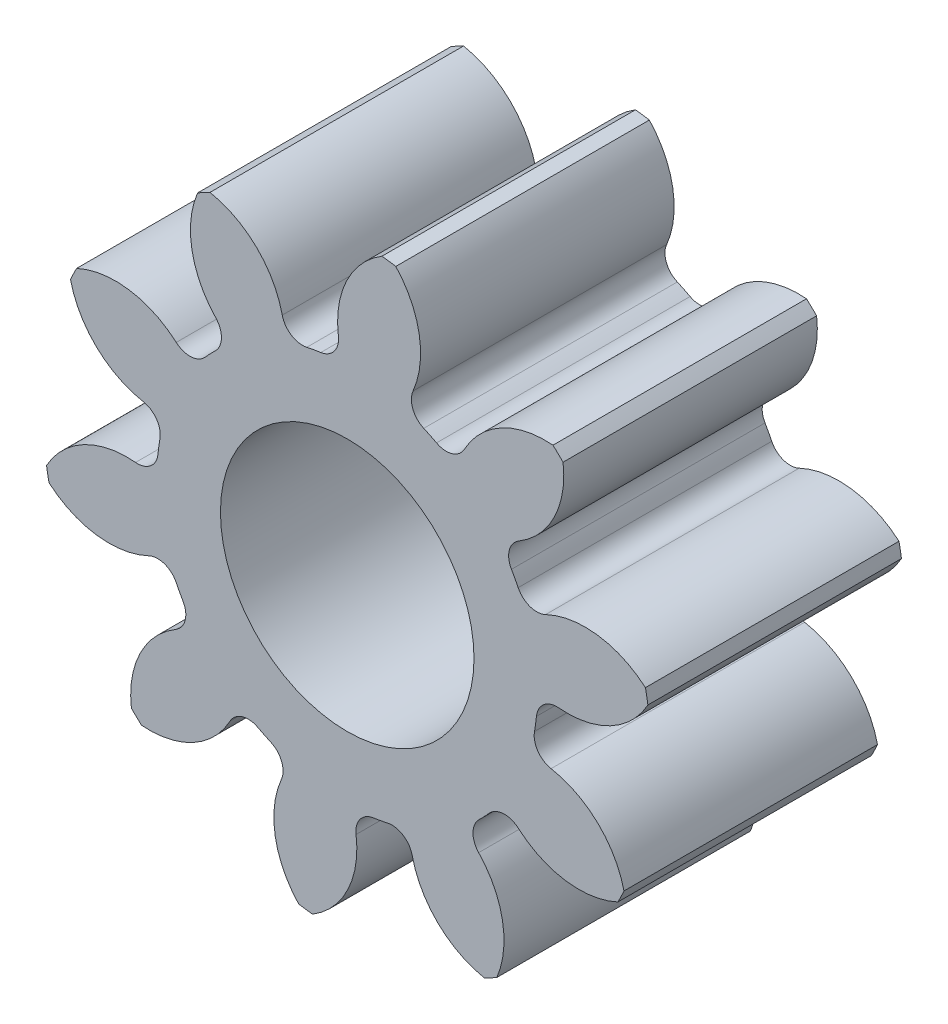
ISO-10303-21;
HEADER;
FILE_DESCRIPTION(('STEP AP214'),'2;1');
FILE_NAME('part.step','',(''),(''),'','','');
FILE_SCHEMA(('AUTOMOTIVE_DESIGN { 1 0 10303 214 1 1 1 1 }'));
ENDSEC;
DATA;
#1=APPLICATION_CONTEXT('core data for automotive mechanical design processes');
#2=APPLICATION_PROTOCOL_DEFINITION('international standard','automotive_design',2000,#1);
#3=PRODUCT_CONTEXT('',#1,'mechanical');
#4=PRODUCT('Part','Part','',(#3));
#5=PRODUCT_RELATED_PRODUCT_CATEGORY('part','',(#4));
#6=PRODUCT_DEFINITION_FORMATION('','',#4);
#7=PRODUCT_DEFINITION_CONTEXT('part definition',#1,'design');
#8=PRODUCT_DEFINITION('design','',#6,#7);
#9=PRODUCT_DEFINITION_SHAPE('','',#8);
#10=(LENGTH_UNIT() NAMED_UNIT(*) SI_UNIT(.MILLI.,.METRE.));
#11=(NAMED_UNIT(*) PLANE_ANGLE_UNIT() SI_UNIT($,.RADIAN.));
#12=(NAMED_UNIT(*) SI_UNIT($,.STERADIAN.) SOLID_ANGLE_UNIT());
#13=UNCERTAINTY_MEASURE_WITH_UNIT(LENGTH_MEASURE(1.E-05),#10,'distance_accuracy_value','');
#14=(GEOMETRIC_REPRESENTATION_CONTEXT(3) GLOBAL_UNCERTAINTY_ASSIGNED_CONTEXT((#13)) GLOBAL_UNIT_ASSIGNED_CONTEXT((#10,
#11,#12)) REPRESENTATION_CONTEXT('',''));
#15=CARTESIAN_POINT('',(0.,0.,0.));
#16=DIRECTION('',(0.,0.,1.));
#17=DIRECTION('',(1.,0.,0.));
#18=AXIS2_PLACEMENT_3D('',#15,#16,#17);
#19=CARTESIAN_POINT('',(0.,0.,101.6));
#20=DIRECTION('',(0.,0.,-1.));
#21=DIRECTION('',(-1.,0.,0.));
#22=AXIS2_PLACEMENT_3D('',#19,#20,#21);
#23=CYLINDRICAL_SURFACE('',#22,121.92);
#24=DIRECTION('',(0.,0.,-1.));
#25=VECTOR('',#24,1.);
#26=CARTESIAN_POINT('',(119.493538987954,24.2029035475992,50.8));
#27=LINE('',#26,#25);
#28=CARTESIAN_POINT('',(119.493538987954,24.2029035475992,101.6));
#29=VERTEX_POINT('',#28);
#30=CARTESIAN_POINT('',(119.493538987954,24.2029035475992,0.));
#31=VERTEX_POINT('',#30);
#32=EDGE_CURVE('E456',#29,#31,#27,.T.);
#33=ORIENTED_EDGE('',*,*,#32,.F.);
#34=CARTESIAN_POINT('',(0.,0.,101.6));
#35=DIRECTION('',(0.,0.,1.));
#36=DIRECTION('',(1.,0.,0.));
#37=AXIS2_PLACEMENT_3D('',#34,#35,#36);
#38=CIRCLE('',#37,121.92);
#39=CARTESIAN_POINT('',(120.48059479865,18.6792043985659,101.6));
#40=VERTEX_POINT('',#39);
#41=EDGE_CURVE('E797',#40,#29,#38,.T.);
#42=ORIENTED_EDGE('',*,*,#41,.F.);
#43=DIRECTION('',(0.,0.,-1.));
#44=VECTOR('',#43,1.);
#45=CARTESIAN_POINT('',(120.48059479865,18.6792043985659,50.8));
#46=LINE('',#45,#44);
#47=CARTESIAN_POINT('',(120.48059479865,18.6792043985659,0.));
#48=VERTEX_POINT('',#47);
#49=EDGE_CURVE('E791',#48,#40,#46,.F.);
#50=ORIENTED_EDGE('',*,*,#49,.F.);
#51=CARTESIAN_POINT('',(0.,0.,0.));
#52=DIRECTION('',(0.,0.,1.));
#53=DIRECTION('',(1.,0.,0.));
#54=AXIS2_PLACEMENT_3D('',#51,#52,#53);
#55=CIRCLE('',#54,121.92);
#56=EDGE_CURVE('E802',#48,#31,#55,.T.);
#57=ORIENTED_EDGE('',*,*,#56,.T.);
#58=EDGE_LOOP('',(#33,#42,#50,#57));
#59=FACE_BOUND('',#58,.T.);
#60=ADVANCED_FACE('F33',(#59),#23,.T.);
#61=DIRECTION('',(0.,0.,-1.));
#62=VECTOR('',#61,1.);
#63=CARTESIAN_POINT('',(86.4914878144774,85.928510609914,50.8));
#64=LINE('',#63,#62);
#65=CARTESIAN_POINT('',(86.4914878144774,85.928510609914,0.));
#66=VERTEX_POINT('',#65);
#67=CARTESIAN_POINT('',(86.4914878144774,85.928510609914,101.6));
#68=VERTEX_POINT('',#67);
#69=EDGE_CURVE('E427',#66,#68,#64,.F.);
#70=ORIENTED_EDGE('',*,*,#69,.F.);
#71=CARTESIAN_POINT('',(82.4461939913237,89.8171002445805,0.));
#72=VERTEX_POINT('',#71);
#73=EDGE_CURVE('E805',#66,#72,#55,.T.);
#74=ORIENTED_EDGE('',*,*,#73,.T.);
#75=DIRECTION('',(0.,0.,-1.));
#76=VECTOR('',#75,1.);
#77=CARTESIAN_POINT('',(82.4461939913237,89.8171002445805,50.8));
#78=LINE('',#77,#76);
#79=CARTESIAN_POINT('',(82.4461939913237,89.8171002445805,101.6));
#80=VERTEX_POINT('',#79);
#81=EDGE_CURVE('E489',#80,#72,#78,.T.);
#82=ORIENTED_EDGE('',*,*,#81,.F.);
#83=EDGE_CURVE('E800',#68,#80,#38,.T.);
#84=ORIENTED_EDGE('',*,*,#83,.F.);
#85=EDGE_LOOP('',(#70,#74,#82,#84));
#86=FACE_BOUND('',#85,.T.);
#87=ADVANCED_FACE('F921',(#86),#23,.T.);
#88=CARTESIAN_POINT('',(0.,0.,101.6));
#89=DIRECTION('',(0.,0.,1.));
#90=DIRECTION('',(1.,0.,0.));
#91=AXIS2_PLACEMENT_3D('',#88,#89,#90);
#92=PLANE('',#91);
#93=CARTESIAN_POINT('',(0.,0.,101.599999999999));
#94=DIRECTION('',(0.,0.,1.));
#95=DIRECTION('',(1.,0.,0.));
#96=AXIS2_PLACEMENT_3D('',#93,#94,#95);
#97=CIRCLE('',#96,50.8);
#98=CARTESIAN_POINT('',(50.8,0.,101.599999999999));
#99=VERTEX_POINT('',#98);
#100=EDGE_CURVE('E444',#99,#99,#97,.T.);
#101=ORIENTED_EDGE('',*,*,#100,.F.);
#102=EDGE_LOOP('',(#101));
#103=FACE_BOUND('',#102,.T.);
#104=ORIENTED_EDGE('',*,*,#41,.T.);
#105=CARTESIAN_POINT('',(95.4000143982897,-3.72654212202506,101.6));
#106=DIRECTION('',(0.,0.,-1.));
#107=DIRECTION('',(0.809016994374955,0.587785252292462,0.));
#108=AXIS2_PLACEMENT_3D('',#105,#106,#107);
#109=CIRCLE('',#108,36.8856593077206);
#110=CARTESIAN_POINT('',(79.4944008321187,29.5535317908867,101.6));
#111=VERTEX_POINT('',#110);
#112=EDGE_CURVE('E436',#111,#29,#109,.T.);
#113=ORIENTED_EDGE('',*,*,#112,.F.);
#114=CARTESIAN_POINT('',(75.9281573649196,37.0153530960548,101.6));
#115=DIRECTION('',(0.,0.,1.));
#116=DIRECTION('',(-0.809016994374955,-0.587785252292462,0.));
#117=AXIS2_PLACEMENT_3D('',#114,#115,#116);
#118=CIRCLE('',#117,8.27024000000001);
#119=CARTESIAN_POINT('',(68.4942482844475,33.3912855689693,101.6));
#120=VERTEX_POINT('',#119);
#121=EDGE_CURVE('E434',#120,#111,#118,.T.);
#122=ORIENTED_EDGE('',*,*,#121,.F.);
#123=CARTESIAN_POINT('',(0.,0.,101.6));
#124=DIRECTION('',(0.,0.,-1.));
#125=DIRECTION('',(0.809016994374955,0.587785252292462,0.));
#126=AXIS2_PLACEMENT_3D('',#123,#124,#125);
#127=CIRCLE('',#126,76.2);
#128=CARTESIAN_POINT('',(65.8084680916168,38.4146525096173,101.6));
#129=VERTEX_POINT('',#128);
#130=EDGE_CURVE('E419',#129,#120,#127,.T.);
#131=ORIENTED_EDGE('',*,*,#130,.F.);
#132=CARTESIAN_POINT('',(72.9508804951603,42.5839227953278,101.6));
#133=DIRECTION('',(0.,0.,1.));
#134=DIRECTION('',(-0.809016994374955,-0.587785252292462,0.));
#135=AXIS2_PLACEMENT_3D('',#132,#133,#134);
#136=CIRCLE('',#135,8.27024000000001);
#137=CARTESIAN_POINT('',(68.7262841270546,49.6937508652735,101.6));
#138=VERTEX_POINT('',#137);
#139=EDGE_CURVE('E411',#138,#129,#136,.T.);
#140=ORIENTED_EDGE('',*,*,#139,.F.);
#141=CARTESIAN_POINT('',(49.8843856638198,81.4039183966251,101.6));
#142=DIRECTION('',(0.,0.,-1.));
#143=DIRECTION('',(-0.809016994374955,-0.587785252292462,0.));
#144=AXIS2_PLACEMENT_3D('',#141,#142,#143);
#145=CIRCLE('',#144,36.8856593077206);
#146=EDGE_CURVE('E441',#68,#138,#145,.T.);
#147=ORIENTED_EDGE('',*,*,#146,.F.);
#148=ORIENTED_EDGE('',*,*,#83,.T.);
#149=CARTESIAN_POINT('',(79.370639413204,53.0598856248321,101.6));
#150=DIRECTION('',(0.,0.,-1.));
#151=DIRECTION('',(0.309016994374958,0.95105651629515,0.));
#152=AXIS2_PLACEMENT_3D('',#149,#150,#151);
#153=CIRCLE('',#152,36.8856593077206);
#154=CARTESIAN_POINT('',(46.9411910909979,70.6349459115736,101.6));
#155=VERTEX_POINT('',#154);
#156=EDGE_CURVE('E465',#155,#80,#153,.T.);
#157=ORIENTED_EDGE('',*,*,#156,.F.);
#158=CARTESIAN_POINT('',(39.6700910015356,74.5755008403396,101.6));
#159=DIRECTION('',(0.,0.,1.));
#160=DIRECTION('',(-0.309016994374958,-0.95105651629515,0.));
#161=AXIS2_PLACEMENT_3D('',#158,#159,#160);
#162=CIRCLE('',#161,8.27024000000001);
#163=CARTESIAN_POINT('',(35.7861056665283,67.2740264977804,101.6));
#164=VERTEX_POINT('',#163);
#165=EDGE_CURVE('E463',#164,#155,#162,.T.);
#166=ORIENTED_EDGE('',*,*,#165,.F.);
#167=CARTESIAN_POINT('',(0.,0.,101.6));
#168=DIRECTION('',(0.,0.,-1.));
#169=DIRECTION('',(0.309016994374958,0.95105651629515,0.));
#170=AXIS2_PLACEMENT_3D('',#167,#168,#169);
#171=CIRCLE('',#170,76.2);
#172=CARTESIAN_POINT('',(30.6606028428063,69.7593537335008,101.6));
#173=VERTEX_POINT('',#172);
#174=EDGE_CURVE('E460',#173,#164,#171,.T.);
#175=ORIENTED_EDGE('',*,*,#174,.F.);
#176=CARTESIAN_POINT('',(33.9883002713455,77.3305689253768,101.6));
#177=DIRECTION('',(0.,0.,1.));
#178=DIRECTION('',(-0.309016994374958,-0.95105651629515,0.));
#179=AXIS2_PLACEMENT_3D('',#176,#177,#178);
#180=CIRCLE('',#179,8.27024000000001);
#181=CARTESIAN_POINT('',(26.3914779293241,80.599385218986,101.6));
#182=VERTEX_POINT('',#181);
#183=EDGE_CURVE('E458',#182,#173,#180,.T.);
#184=ORIENTED_EDGE('',*,*,#183,.F.);
#185=CARTESIAN_POINT('',(-7.4907069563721,95.1784596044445,101.6));
#186=DIRECTION('',(0.,0.,-1.));
#187=DIRECTION('',(-0.309016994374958,-0.95105651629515,0.));
#188=AXIS2_PLACEMENT_3D('',#185,#186,#187);
#189=CIRCLE('',#188,36.8856593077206);
#190=CARTESIAN_POINT('',(19.465572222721,120.356046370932,101.6));
#191=VERTEX_POINT('',#190);
#192=EDGE_CURVE('E468',#191,#182,#189,.T.);
#193=ORIENTED_EDGE('',*,*,#192,.F.);
#194=CARTESIAN_POINT('',(13.9072051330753,121.124217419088,101.6));
#195=VERTEX_POINT('',#194);
#196=EDGE_CURVE('E833',#191,#195,#38,.T.);
#197=ORIENTED_EDGE('',*,*,#196,.T.);
#198=CARTESIAN_POINT('',(33.0243778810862,89.5792405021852,101.6));
#199=DIRECTION('',(0.,0.,-1.));
#200=DIRECTION('',(-0.309016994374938,0.951056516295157,0.));
#201=AXIS2_PLACEMENT_3D('',#198,#199,#200);
#202=CIRCLE('',#201,36.8856593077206);
#203=CARTESIAN_POINT('',(-3.54195817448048,84.7362114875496,101.6));
#204=VERTEX_POINT('',#203);
#205=EDGE_CURVE('E500',#204,#195,#202,.T.);
#206=ORIENTED_EDGE('',*,*,#205,.F.);
#207=CARTESIAN_POINT('',(-11.7406017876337,83.6503419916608,101.6));
#208=DIRECTION('',(0.,0.,1.));
#209=DIRECTION('',(0.309016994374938,-0.951056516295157,0.));
#210=AXIS2_PLACEMENT_3D('',#207,#208,#209);
#211=CIRCLE('',#210,8.27024000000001);
#212=CARTESIAN_POINT('',(-10.5911129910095,75.4603758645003,101.6));
#213=VERTEX_POINT('',#212);
#214=EDGE_CURVE('E498',#213,#204,#211,.T.);
#215=ORIENTED_EDGE('',*,*,#214,.F.);
#216=CARTESIAN_POINT('',(0.,0.,101.6));
#217=DIRECTION('',(0.,0.,-1.));
#218=DIRECTION('',(-0.309016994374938,0.951056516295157,0.));
#219=AXIS2_PLACEMENT_3D('',#216,#217,#218);
#220=CIRCLE('',#219,76.2);
#221=CARTESIAN_POINT('',(-16.1985705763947,74.4583528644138,101.6));
#222=VERTEX_POINT('',#221);
#223=EDGE_CURVE('E495',#222,#213,#220,.T.);
#224=ORIENTED_EDGE('',*,*,#223,.F.);
#225=CARTESIAN_POINT('',(-17.9566554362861,82.5395660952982,101.6));
#226=DIRECTION('',(0.,0.,1.));
#227=DIRECTION('',(0.309016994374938,-0.951056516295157,0.));
#228=AXIS2_PLACEMENT_3D('',#225,#226,#227);
#229=CIRCLE('',#228,8.27024000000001);
#230=CARTESIAN_POINT('',(-26.0239758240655,80.7187938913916,101.6));
#231=VERTEX_POINT('',#230);
#232=EDGE_CURVE('E493',#231,#222,#229,.T.);
#233=ORIENTED_EDGE('',*,*,#232,.F.);
#234=CARTESIAN_POINT('',(-62.0046041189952,72.5980642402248,101.6));
#235=DIRECTION('',(0.,0.,-1.));
#236=DIRECTION('',(0.309016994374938,-0.951056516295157,0.));
#237=AXIS2_PLACEMENT_3D('',#234,#235,#236);
#238=CIRCLE('',#237,36.8856593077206);
#239=CARTESIAN_POINT('',(-54.995530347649,108.811663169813,101.6));
#240=VERTEX_POINT('',#239);
#241=EDGE_CURVE('E503',#240,#231,#238,.T.);
#242=ORIENTED_EDGE('',*,*,#241,.F.);
#243=CARTESIAN_POINT('',(-59.9438633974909,106.166000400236,101.6));
#244=VERTEX_POINT('',#243);
#245=EDGE_CURVE('E903',#240,#244,#38,.T.);
#246=ORIENTED_EDGE('',*,*,#245,.T.);
#247=CARTESIAN_POINT('',(-25.9360735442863,91.8823701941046,101.6));
#248=DIRECTION('',(0.,0.,-1.));
#249=DIRECTION('',(-0.809016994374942,0.58778525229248,0.));
#250=AXIS2_PLACEMENT_3D('',#247,#248,#249);
#251=CIRCLE('',#250,36.8856593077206);
#252=CARTESIAN_POINT('',(-52.6721998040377,66.4711243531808,101.6));
#253=VERTEX_POINT('',#252);
#254=EDGE_CURVE('E538',#253,#244,#251,.T.);
#255=ORIENTED_EDGE('',*,*,#254,.F.);
#256=CARTESIAN_POINT('',(-58.6667837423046,60.7735956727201,101.6));
#257=DIRECTION('',(0.,0.,1.));
#258=DIRECTION('',(0.809016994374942,-0.58778525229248,0.));
#259=AXIS2_PLACEMENT_3D('',#256,#257,#258);
#260=CIRCLE('',#259,8.27024000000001);
#261=CARTESIAN_POINT('',(-52.9228864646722,54.8234264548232,101.6));
#262=VERTEX_POINT('',#261);
#263=EDGE_CURVE('E536',#262,#253,#260,.T.);
#264=ORIENTED_EDGE('',*,*,#263,.F.);
#265=CARTESIAN_POINT('',(0.,0.,101.6));
#266=DIRECTION('',(0.,0.,-1.));
#267=DIRECTION('',(-0.809016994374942,0.58778525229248,0.));
#268=AXIS2_PLACEMENT_3D('',#265,#266,#267);
#269=CIRCLE('',#268,76.2);
#270=CARTESIAN_POINT('',(-56.8704406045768,50.7167919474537,101.6));
#271=VERTEX_POINT('',#270);
#272=EDGE_CURVE('E533',#271,#262,#269,.T.);
#273=ORIENTED_EDGE('',*,*,#272,.F.);
#274=CARTESIAN_POINT('',(-63.0427790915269,56.221254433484,101.6));
#275=DIRECTION('',(0.,0.,1.));
#276=DIRECTION('',(0.809016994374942,-0.58778525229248,0.));
#277=AXIS2_PLACEMENT_3D('',#274,#275,#276);
#278=CIRCLE('',#277,8.27024000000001);
#279=CARTESIAN_POINT('',(-68.4991553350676,50.0063668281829,101.6));
#280=VERTEX_POINT('',#279);
#281=EDGE_CURVE('E531',#280,#271,#278,.T.);
#282=ORIENTED_EDGE('',*,*,#281,.F.);
#283=CARTESIAN_POINT('',(-92.8348499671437,22.2876758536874,101.6));
#284=DIRECTION('',(0.,0.,-1.));
#285=DIRECTION('',(0.809016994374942,-0.58778525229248,0.));
#286=AXIS2_PLACEMENT_3D('',#283,#284,#285);
#287=CIRCLE('',#286,36.8856593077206);
#288=CARTESIAN_POINT('',(-108.450209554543,55.7049230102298,101.6));
#289=VERTEX_POINT('',#288);
#290=EDGE_CURVE('E541',#289,#280,#287,.T.);
#291=ORIENTED_EDGE('',*,*,#290,.F.);
#292=CARTESIAN_POINT('',(-110.898413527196,50.6559796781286,101.6));
#293=VERTEX_POINT('',#292);
#294=EDGE_CURVE('E899',#289,#293,#38,.T.);
#295=ORIENTED_EDGE('',*,*,#294,.T.);
#296=CARTESIAN_POINT('',(-74.9898264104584,59.0895574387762,101.6));
#297=DIRECTION('',(0.,0.,-1.));
#298=DIRECTION('',(-1.,0.,0.));
#299=AXIS2_PLACEMENT_3D('',#296,#297,#298);
#300=CIRCLE('',#299,36.8856593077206);
#301=CARTESIAN_POINT('',(-81.6834513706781,22.8163269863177,101.6));
#302=VERTEX_POINT('',#301);
#303=EDGE_CURVE('E576',#302,#293,#300,.T.);
#304=ORIENTED_EDGE('',*,*,#303,.F.);
#305=CARTESIAN_POINT('',(-83.1842483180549,14.6834014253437,101.6));
#306=DIRECTION('',(0.,0.,1.));
#307=DIRECTION('',(1.,0.,0.));
#308=AXIS2_PLACEMENT_3D('',#305,#306,#307);
#309=CIRCLE('',#308,8.27024000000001);
#310=CARTESIAN_POINT('',(-75.0399160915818,13.2457915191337,101.6));
#311=VERTEX_POINT('',#310);
#312=EDGE_CURVE('E574',#311,#302,#309,.T.);
#313=ORIENTED_EDGE('',*,*,#312,.F.);
#314=CARTESIAN_POINT('',(0.,0.,101.6));
#315=DIRECTION('',(0.,0.,-1.));
#316=DIRECTION('',(-1.,0.,0.));
#317=AXIS2_PLACEMENT_3D('',#314,#315,#316);
#318=CIRCLE('',#317,76.2);
#319=CARTESIAN_POINT('',(-75.8197352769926,7.6031403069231,101.6));
#320=VERTEX_POINT('',#319);
#321=EDGE_CURVE('E571',#320,#311,#318,.T.);
#322=ORIENTED_EDGE('',*,*,#321,.F.);
#323=CARTESIAN_POINT('',(-84.0487038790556,8.42833446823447,101.6));
#324=DIRECTION('',(0.,0.,1.));
#325=DIRECTION('',(1.,0.,0.));
#326=AXIS2_PLACEMENT_3D('',#323,#324,#325);
#327=CIRCLE('',#326,8.27024000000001);
#328=CARTESIAN_POINT('',(-84.8099857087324,0.193207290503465,101.6));
#329=VERTEX_POINT('',#328);
#330=EDGE_CURVE('E569',#329,#320,#327,.T.);
#331=ORIENTED_EDGE('',*,*,#330,.F.);
#332=CARTESIAN_POINT('',(-88.2053384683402,-36.5358471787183,101.6));
#333=DIRECTION('',(0.,0.,-1.));
#334=DIRECTION('',(1.,0.,0.));
#335=AXIS2_PLACEMENT_3D('',#332,#333,#334);
#336=CIRCLE('',#335,36.8856593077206);
#337=CARTESIAN_POINT('',(-120.480594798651,-18.6792043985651,101.6));
#338=VERTEX_POINT('',#337);
#339=EDGE_CURVE('E579',#338,#329,#336,.T.);
#340=ORIENTED_EDGE('',*,*,#339,.F.);
#341=CARTESIAN_POINT('',(-119.493538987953,-24.2029035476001,101.6));
#342=VERTEX_POINT('',#341);
#343=EDGE_CURVE('E895',#338,#342,#38,.T.);
#344=ORIENTED_EDGE('',*,*,#343,.T.);
#345=CARTESIAN_POINT('',(-95.4000143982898,3.72654212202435,101.6));
#346=DIRECTION('',(0.,0.,-1.));
#347=DIRECTION('',(-0.809016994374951,-0.587785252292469,0.));
#348=AXIS2_PLACEMENT_3D('',#345,#346,#347);
#349=CIRCLE('',#348,36.8856593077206);
#350=CARTESIAN_POINT('',(-79.4944008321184,-29.5535317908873,101.6));
#351=VERTEX_POINT('',#350);
#352=EDGE_CURVE('E614',#351,#342,#349,.T.);
#353=ORIENTED_EDGE('',*,*,#352,.F.);
#354=CARTESIAN_POINT('',(-75.9281573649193,-37.0153530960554,101.6));
#355=DIRECTION('',(0.,0.,1.));
#356=DIRECTION('',(0.809016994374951,0.587785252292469,0.));
#357=AXIS2_PLACEMENT_3D('',#354,#355,#356);
#358=CIRCLE('',#357,8.27024000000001);
#359=CARTESIAN_POINT('',(-68.4942482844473,-33.3912855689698,101.6));
#360=VERTEX_POINT('',#359);
#361=EDGE_CURVE('E612',#360,#351,#358,.T.);
#362=ORIENTED_EDGE('',*,*,#361,.F.);
#363=CARTESIAN_POINT('',(0.,0.,101.6));
#364=DIRECTION('',(0.,0.,-1.));
#365=DIRECTION('',(-0.809016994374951,-0.587785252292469,0.));
#366=AXIS2_PLACEMENT_3D('',#363,#364,#365);
#367=CIRCLE('',#366,76.2);
#368=CARTESIAN_POINT('',(-65.8084680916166,-38.4146525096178,101.6));
#369=VERTEX_POINT('',#368);
#370=EDGE_CURVE('E609',#369,#360,#367,.T.);
#371=ORIENTED_EDGE('',*,*,#370,.F.);
#372=CARTESIAN_POINT('',(-72.95088049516,-42.5839227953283,101.6));
#373=DIRECTION('',(0.,0.,1.));
#374=DIRECTION('',(0.809016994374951,0.587785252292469,0.));
#375=AXIS2_PLACEMENT_3D('',#372,#373,#374);
#376=CIRCLE('',#375,8.27024000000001);
#377=CARTESIAN_POINT('',(-68.7262841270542,-49.693750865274,101.6));
#378=VERTEX_POINT('',#377);
#379=EDGE_CURVE('E607',#378,#369,#376,.T.);
#380=ORIENTED_EDGE('',*,*,#379,.F.);
#381=CARTESIAN_POINT('',(-49.8843856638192,-81.4039183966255,101.6));
#382=DIRECTION('',(0.,0.,-1.));
#383=DIRECTION('',(0.809016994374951,0.587785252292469,0.));
#384=AXIS2_PLACEMENT_3D('',#381,#382,#383);
#385=CIRCLE('',#384,36.8856593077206);
#386=CARTESIAN_POINT('',(-86.4914878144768,-85.9285106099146,101.6));
#387=VERTEX_POINT('',#386);
#388=EDGE_CURVE('E617',#387,#378,#385,.T.);
#389=ORIENTED_EDGE('',*,*,#388,.F.);
#390=CARTESIAN_POINT('',(-82.4461939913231,-89.817100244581,101.6));
#391=VERTEX_POINT('',#390);
#392=EDGE_CURVE('E891',#387,#391,#38,.T.);
#393=ORIENTED_EDGE('',*,*,#392,.T.);
#394=CARTESIAN_POINT('',(-79.3706394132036,-53.0598856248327,101.6));
#395=DIRECTION('',(0.,0.,-1.));
#396=DIRECTION('',(-0.309016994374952,-0.951056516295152,0.));
#397=AXIS2_PLACEMENT_3D('',#394,#395,#396);
#398=CIRCLE('',#397,36.8856593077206);
#399=CARTESIAN_POINT('',(-46.9411910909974,-70.634945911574,101.6));
#400=VERTEX_POINT('',#399);
#401=EDGE_CURVE('E652',#400,#391,#398,.T.);
#402=ORIENTED_EDGE('',*,*,#401,.F.);
#403=CARTESIAN_POINT('',(-39.6700910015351,-74.5755008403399,101.6));
#404=DIRECTION('',(0.,0.,1.));
#405=DIRECTION('',(0.309016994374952,0.951056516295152,0.));
#406=AXIS2_PLACEMENT_3D('',#403,#404,#405);
#407=CIRCLE('',#406,8.27024000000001);
#408=CARTESIAN_POINT('',(-35.7861056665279,-67.2740264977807,101.6));
#409=VERTEX_POINT('',#408);
#410=EDGE_CURVE('E650',#409,#400,#407,.T.);
#411=ORIENTED_EDGE('',*,*,#410,.F.);
#412=CARTESIAN_POINT('',(0.,0.,101.6));
#413=DIRECTION('',(0.,0.,-1.));
#414=DIRECTION('',(-0.309016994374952,-0.951056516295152,0.));
#415=AXIS2_PLACEMENT_3D('',#412,#413,#414);
#416=CIRCLE('',#415,76.2);
#417=CARTESIAN_POINT('',(-30.6606028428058,-69.7593537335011,101.6));
#418=VERTEX_POINT('',#417);
#419=EDGE_CURVE('E647',#418,#409,#416,.T.);
#420=ORIENTED_EDGE('',*,*,#419,.F.);
#421=CARTESIAN_POINT('',(-33.988300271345,-77.3305689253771,101.6));
#422=DIRECTION('',(0.,0.,1.));
#423=DIRECTION('',(0.309016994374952,0.951056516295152,0.));
#424=AXIS2_PLACEMENT_3D('',#421,#422,#423);
#425=CIRCLE('',#424,8.27024000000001);
#426=CARTESIAN_POINT('',(-26.3914779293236,-80.5993852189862,101.6));
#427=VERTEX_POINT('',#426);
#428=EDGE_CURVE('E645',#427,#418,#425,.T.);
#429=ORIENTED_EDGE('',*,*,#428,.F.);
#430=CARTESIAN_POINT('',(7.49070695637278,-95.1784596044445,101.6));
#431=DIRECTION('',(0.,0.,-1.));
#432=DIRECTION('',(0.309016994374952,0.951056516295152,0.));
#433=AXIS2_PLACEMENT_3D('',#430,#431,#432);
#434=CIRCLE('',#433,36.8856593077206);
#435=CARTESIAN_POINT('',(-19.4655722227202,-120.356046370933,101.6));
#436=VERTEX_POINT('',#435);
#437=EDGE_CURVE('E655',#436,#427,#434,.T.);
#438=ORIENTED_EDGE('',*,*,#437,.F.);
#439=CARTESIAN_POINT('',(-13.9072051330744,-121.124217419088,101.6));
#440=VERTEX_POINT('',#439);
#441=EDGE_CURVE('E887',#436,#440,#38,.T.);
#442=ORIENTED_EDGE('',*,*,#441,.T.);
#443=CARTESIAN_POINT('',(-33.0243778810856,-89.5792405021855,101.6));
#444=DIRECTION('',(0.,0.,-1.));
#445=DIRECTION('',(0.309016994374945,-0.951056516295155,0.));
#446=AXIS2_PLACEMENT_3D('',#443,#444,#445);
#447=CIRCLE('',#446,36.8856593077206);
#448=CARTESIAN_POINT('',(3.54195817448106,-84.7362114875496,101.6));
#449=VERTEX_POINT('',#448);
#450=EDGE_CURVE('E690',#449,#440,#447,.T.);
#451=ORIENTED_EDGE('',*,*,#450,.F.);
#452=CARTESIAN_POINT('',(11.7406017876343,-83.6503419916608,101.6));
#453=DIRECTION('',(0.,0.,1.));
#454=DIRECTION('',(-0.309016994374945,0.951056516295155,0.));
#455=AXIS2_PLACEMENT_3D('',#452,#453,#454);
#456=CIRCLE('',#455,8.27024000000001);
#457=CARTESIAN_POINT('',(10.59111299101,-75.4603758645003,101.6));
#458=VERTEX_POINT('',#457);
#459=EDGE_CURVE('E688',#458,#449,#456,.T.);
#460=ORIENTED_EDGE('',*,*,#459,.F.);
#461=CARTESIAN_POINT('',(0.,0.,101.6));
#462=DIRECTION('',(0.,0.,-1.));
#463=DIRECTION('',(0.309016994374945,-0.951056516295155,0.));
#464=AXIS2_PLACEMENT_3D('',#461,#462,#463);
#465=CIRCLE('',#464,76.2);
#466=CARTESIAN_POINT('',(16.1985705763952,-74.4583528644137,101.6));
#467=VERTEX_POINT('',#466);
#468=EDGE_CURVE('E685',#467,#458,#465,.T.);
#469=ORIENTED_EDGE('',*,*,#468,.F.);
#470=CARTESIAN_POINT('',(17.9566554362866,-82.5395660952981,101.6));
#471=DIRECTION('',(0.,0.,1.));
#472=DIRECTION('',(-0.309016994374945,0.951056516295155,0.));
#473=AXIS2_PLACEMENT_3D('',#470,#471,#472);
#474=CIRCLE('',#473,8.27024000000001);
#475=CARTESIAN_POINT('',(26.023975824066,-80.7187938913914,101.6));
#476=VERTEX_POINT('',#475);
#477=EDGE_CURVE('E683',#476,#467,#474,.T.);
#478=ORIENTED_EDGE('',*,*,#477,.F.);
#479=CARTESIAN_POINT('',(62.0046041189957,-72.5980642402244,101.6));
#480=DIRECTION('',(0.,0.,-1.));
#481=DIRECTION('',(-0.309016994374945,0.951056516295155,0.));
#482=AXIS2_PLACEMENT_3D('',#479,#480,#481);
#483=CIRCLE('',#482,36.8856593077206);
#484=CARTESIAN_POINT('',(54.9955303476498,-108.811663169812,101.6));
#485=VERTEX_POINT('',#484);
#486=EDGE_CURVE('E693',#485,#476,#483,.T.);
#487=ORIENTED_EDGE('',*,*,#486,.F.);
#488=CARTESIAN_POINT('',(59.9438633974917,-106.166000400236,101.6));
#489=VERTEX_POINT('',#488);
#490=EDGE_CURVE('E886',#485,#489,#38,.T.);
#491=ORIENTED_EDGE('',*,*,#490,.T.);
#492=CARTESIAN_POINT('',(25.936073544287,-91.8823701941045,101.6));
#493=DIRECTION('',(0.,0.,-1.));
#494=DIRECTION('',(0.809016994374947,-0.587785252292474,0.));
#495=AXIS2_PLACEMENT_3D('',#492,#493,#494);
#496=CIRCLE('',#495,36.8856593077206);
#497=CARTESIAN_POINT('',(52.6721998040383,-66.4711243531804,101.6));
#498=VERTEX_POINT('',#497);
#499=EDGE_CURVE('E728',#498,#489,#496,.T.);
#500=ORIENTED_EDGE('',*,*,#499,.F.);
#501=CARTESIAN_POINT('',(58.6667837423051,-60.7735956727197,101.6));
#502=DIRECTION('',(0.,0.,1.));
#503=DIRECTION('',(-0.809016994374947,0.587785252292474,0.));
#504=AXIS2_PLACEMENT_3D('',#501,#502,#503);
#505=CIRCLE('',#504,8.27024000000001);
#506=CARTESIAN_POINT('',(52.9228864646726,-54.8234264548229,101.6));
#507=VERTEX_POINT('',#506);
#508=EDGE_CURVE('E726',#507,#498,#505,.T.);
#509=ORIENTED_EDGE('',*,*,#508,.F.);
#510=CARTESIAN_POINT('',(0.,0.,101.6));
#511=DIRECTION('',(0.,0.,-1.));
#512=DIRECTION('',(0.809016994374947,-0.587785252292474,0.));
#513=AXIS2_PLACEMENT_3D('',#510,#511,#512);
#514=CIRCLE('',#513,76.2);
#515=CARTESIAN_POINT('',(56.8704406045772,-50.7167919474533,101.6));
#516=VERTEX_POINT('',#515);
#517=EDGE_CURVE('E723',#516,#507,#514,.T.);
#518=ORIENTED_EDGE('',*,*,#517,.F.);
#519=CARTESIAN_POINT('',(63.0427790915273,-56.2212544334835,101.6));
#520=DIRECTION('',(0.,0.,1.));
#521=DIRECTION('',(-0.809016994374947,0.587785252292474,0.));
#522=AXIS2_PLACEMENT_3D('',#519,#520,#521);
#523=CIRCLE('',#522,8.27024000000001);
#524=CARTESIAN_POINT('',(68.4991553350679,-50.0063668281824,101.6));
#525=VERTEX_POINT('',#524);
#526=EDGE_CURVE('E721',#525,#516,#523,.T.);
#527=ORIENTED_EDGE('',*,*,#526,.F.);
#528=CARTESIAN_POINT('',(92.8348499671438,-22.2876758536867,101.6));
#529=DIRECTION('',(0.,0.,-1.));
#530=DIRECTION('',(-0.809016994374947,0.587785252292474,0.));
#531=AXIS2_PLACEMENT_3D('',#528,#529,#530);
#532=CIRCLE('',#531,36.8856593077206);
#533=CARTESIAN_POINT('',(108.450209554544,-55.704923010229,101.6));
#534=VERTEX_POINT('',#533);
#535=EDGE_CURVE('E731',#534,#525,#532,.T.);
#536=ORIENTED_EDGE('',*,*,#535,.F.);
#537=CARTESIAN_POINT('',(110.898413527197,-50.6559796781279,101.6));
#538=VERTEX_POINT('',#537);
#539=EDGE_CURVE('E801',#534,#538,#38,.T.);
#540=ORIENTED_EDGE('',*,*,#539,.T.);
#541=CARTESIAN_POINT('',(74.9898264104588,-59.0895574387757,101.6));
#542=DIRECTION('',(0.,0.,-1.));
#543=DIRECTION('',(1.,0.,0.));
#544=AXIS2_PLACEMENT_3D('',#541,#542,#543);
#545=CIRCLE('',#544,36.8856593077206);
#546=CARTESIAN_POINT('',(81.6834513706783,-22.8163269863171,101.6));
#547=VERTEX_POINT('',#546);
#548=EDGE_CURVE('E766',#547,#538,#545,.T.);
#549=ORIENTED_EDGE('',*,*,#548,.F.);
#550=CARTESIAN_POINT('',(83.184248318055,-14.6834014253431,101.6));
#551=DIRECTION('',(0.,0.,1.));
#552=DIRECTION('',(-1.,0.,0.));
#553=AXIS2_PLACEMENT_3D('',#550,#551,#552);
#554=CIRCLE('',#553,8.27024000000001);
#555=CARTESIAN_POINT('',(75.0399160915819,-13.2457915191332,101.6));
#556=VERTEX_POINT('',#555);
#557=EDGE_CURVE('E764',#556,#547,#554,.T.);
#558=ORIENTED_EDGE('',*,*,#557,.F.);
#559=CARTESIAN_POINT('',(0.,0.,101.6));
#560=DIRECTION('',(0.,0.,-1.));
#561=DIRECTION('',(1.,0.,0.));
#562=AXIS2_PLACEMENT_3D('',#559,#560,#561);
#563=CIRCLE('',#562,76.2);
#564=CARTESIAN_POINT('',(75.8197352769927,-7.60314030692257,101.6));
#565=VERTEX_POINT('',#564);
#566=EDGE_CURVE('E761',#565,#556,#563,.T.);
#567=ORIENTED_EDGE('',*,*,#566,.F.);
#568=CARTESIAN_POINT('',(84.0487038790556,-8.42833446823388,101.6));
#569=DIRECTION('',(0.,0.,1.));
#570=DIRECTION('',(-1.,0.,0.));
#571=AXIS2_PLACEMENT_3D('',#568,#569,#570);
#572=CIRCLE('',#571,8.27024000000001);
#573=CARTESIAN_POINT('',(84.8099857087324,-0.193207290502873,101.6));
#574=VERTEX_POINT('',#573);
#575=EDGE_CURVE('E759',#574,#565,#572,.T.);
#576=ORIENTED_EDGE('',*,*,#575,.F.);
#577=CARTESIAN_POINT('',(88.2053384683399,36.5358471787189,101.6));
#578=DIRECTION('',(0.,0.,-1.));
#579=DIRECTION('',(-1.,0.,0.));
#580=AXIS2_PLACEMENT_3D('',#577,#578,#579);
#581=CIRCLE('',#580,36.8856593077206);
#582=EDGE_CURVE('E769',#40,#574,#581,.T.);
#583=ORIENTED_EDGE('',*,*,#582,.F.);
#584=EDGE_LOOP('',(#104,#113,#122,#131,#140,#147,#148,#157,#166,#175,#184,#193,#197,#206,#215,
#224,#233,#242,#246,#255,#264,#273,#282,#291,#295,#304,#313,#322,#331,#340,#344,#353,#362,#371,
#380,#389,#393,#402,#411,#420,#429,#438,#442,#451,#460,#469,#478,#487,#491,#500,#509,#518,#527,
#536,#540,#549,#558,#567,#576,#583));
#585=FACE_BOUND('',#584,.T.);
#586=ADVANCED_FACE('F432',(#103,#585),#92,.T.);
#587=CARTESIAN_POINT('',(0.,0.,0.));
#588=DIRECTION('',(0.,0.,1.));
#589=DIRECTION('',(1.,0.,0.));
#590=AXIS2_PLACEMENT_3D('',#587,#588,#589);
#591=PLANE('',#590);
#592=CARTESIAN_POINT('',(0.,0.,0.));
#593=DIRECTION('',(0.,0.,1.));
#594=DIRECTION('',(1.,0.,0.));
#595=AXIS2_PLACEMENT_3D('',#592,#593,#594);
#596=CIRCLE('',#595,50.8);
#597=CARTESIAN_POINT('',(50.8,0.,-1.77635683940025E-12));
#598=VERTEX_POINT('',#597);
#599=EDGE_CURVE('E36',#598,#598,#596,.T.);
#600=ORIENTED_EDGE('',*,*,#599,.T.);
#601=EDGE_LOOP('',(#600));
#602=FACE_BOUND('',#601,.T.);
#603=CARTESIAN_POINT('',(95.4000143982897,-3.72654212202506,0.));
#604=DIRECTION('',(0.,0.,-1.));
#605=DIRECTION('',(0.809016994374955,0.587785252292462,0.));
#606=AXIS2_PLACEMENT_3D('',#603,#604,#605);
#607=CIRCLE('',#606,36.8856593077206);
#608=CARTESIAN_POINT('',(79.4944008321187,29.5535317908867,0.));
#609=VERTEX_POINT('',#608);
#610=EDGE_CURVE('E420',#609,#31,#607,.T.);
#611=ORIENTED_EDGE('',*,*,#610,.T.);
#612=ORIENTED_EDGE('',*,*,#56,.F.);
#613=CARTESIAN_POINT('',(88.2053384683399,36.5358471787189,0.));
#614=DIRECTION('',(0.,0.,1.));
#615=DIRECTION('',(1.,0.,0.));
#616=AXIS2_PLACEMENT_3D('',#613,#614,#615);
#617=CIRCLE('',#616,36.8856593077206);
#618=CARTESIAN_POINT('',(84.8099857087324,-0.193207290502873,0.));
#619=VERTEX_POINT('',#618);
#620=EDGE_CURVE('E799',#619,#48,#617,.T.);
#621=ORIENTED_EDGE('',*,*,#620,.F.);
#622=CARTESIAN_POINT('',(84.0487038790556,-8.42833446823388,0.));
#623=DIRECTION('',(0.,0.,1.));
#624=DIRECTION('',(-1.,0.,0.));
#625=AXIS2_PLACEMENT_3D('',#622,#623,#624);
#626=CIRCLE('',#625,8.27024000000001);
#627=CARTESIAN_POINT('',(75.8197352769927,-7.60314030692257,0.));
#628=VERTEX_POINT('',#627);
#629=EDGE_CURVE('E758',#619,#628,#626,.T.);
#630=ORIENTED_EDGE('',*,*,#629,.T.);
#631=CARTESIAN_POINT('',(0.,0.,0.));
#632=DIRECTION('',(0.,0.,-1.));
#633=DIRECTION('',(1.,0.,0.));
#634=AXIS2_PLACEMENT_3D('',#631,#632,#633);
#635=CIRCLE('',#634,76.2);
#636=CARTESIAN_POINT('',(75.0399160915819,-13.2457915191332,0.));
#637=VERTEX_POINT('',#636);
#638=EDGE_CURVE('E774',#628,#637,#635,.T.);
#639=ORIENTED_EDGE('',*,*,#638,.T.);
#640=CARTESIAN_POINT('',(83.184248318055,-14.6834014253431,0.));
#641=DIRECTION('',(0.,0.,1.));
#642=DIRECTION('',(-1.,0.,0.));
#643=AXIS2_PLACEMENT_3D('',#640,#641,#642);
#644=CIRCLE('',#643,8.27024000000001);
#645=CARTESIAN_POINT('',(81.6834513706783,-22.8163269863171,0.));
#646=VERTEX_POINT('',#645);
#647=EDGE_CURVE('E777',#637,#646,#644,.T.);
#648=ORIENTED_EDGE('',*,*,#647,.T.);
#649=CARTESIAN_POINT('',(74.9898264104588,-59.0895574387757,0.));
#650=DIRECTION('',(0.,0.,-1.));
#651=DIRECTION('',(1.,0.,0.));
#652=AXIS2_PLACEMENT_3D('',#649,#650,#651);
#653=CIRCLE('',#652,36.8856593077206);
#654=CARTESIAN_POINT('',(110.898413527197,-50.6559796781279,0.));
#655=VERTEX_POINT('',#654);
#656=EDGE_CURVE('E762',#646,#655,#653,.T.);
#657=ORIENTED_EDGE('',*,*,#656,.T.);
#658=CARTESIAN_POINT('',(108.450209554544,-55.704923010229,0.));
#659=VERTEX_POINT('',#658);
#660=EDGE_CURVE('E796',#659,#655,#55,.T.);
#661=ORIENTED_EDGE('',*,*,#660,.F.);
#662=CARTESIAN_POINT('',(92.8348499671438,-22.2876758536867,0.));
#663=DIRECTION('',(0.,0.,1.));
#664=DIRECTION('',(1.,0.,0.));
#665=AXIS2_PLACEMENT_3D('',#662,#663,#664);
#666=CIRCLE('',#665,36.8856593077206);
#667=CARTESIAN_POINT('',(68.4991553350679,-50.0063668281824,0.));
#668=VERTEX_POINT('',#667);
#669=EDGE_CURVE('E807',#668,#659,#666,.T.);
#670=ORIENTED_EDGE('',*,*,#669,.F.);
#671=CARTESIAN_POINT('',(63.0427790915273,-56.2212544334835,0.));
#672=DIRECTION('',(0.,0.,1.));
#673=DIRECTION('',(-0.809016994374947,0.587785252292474,0.));
#674=AXIS2_PLACEMENT_3D('',#671,#672,#673);
#675=CIRCLE('',#674,8.27024000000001);
#676=CARTESIAN_POINT('',(56.8704406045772,-50.7167919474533,0.));
#677=VERTEX_POINT('',#676);
#678=EDGE_CURVE('E720',#668,#677,#675,.T.);
#679=ORIENTED_EDGE('',*,*,#678,.T.);
#680=CARTESIAN_POINT('',(0.,0.,0.));
#681=DIRECTION('',(0.,0.,-1.));
#682=DIRECTION('',(0.809016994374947,-0.587785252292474,0.));
#683=AXIS2_PLACEMENT_3D('',#680,#681,#682);
#684=CIRCLE('',#683,76.2);
#685=CARTESIAN_POINT('',(52.9228864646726,-54.8234264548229,0.));
#686=VERTEX_POINT('',#685);
#687=EDGE_CURVE('E736',#677,#686,#684,.T.);
#688=ORIENTED_EDGE('',*,*,#687,.T.);
#689=CARTESIAN_POINT('',(58.6667837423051,-60.7735956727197,0.));
#690=DIRECTION('',(0.,0.,1.));
#691=DIRECTION('',(-0.809016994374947,0.587785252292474,0.));
#692=AXIS2_PLACEMENT_3D('',#689,#690,#691);
#693=CIRCLE('',#692,8.27024000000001);
#694=CARTESIAN_POINT('',(52.6721998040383,-66.4711243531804,0.));
#695=VERTEX_POINT('',#694);
#696=EDGE_CURVE('E739',#686,#695,#693,.T.);
#697=ORIENTED_EDGE('',*,*,#696,.T.);
#698=CARTESIAN_POINT('',(25.936073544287,-91.8823701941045,0.));
#699=DIRECTION('',(0.,0.,-1.));
#700=DIRECTION('',(0.809016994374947,-0.587785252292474,0.));
#701=AXIS2_PLACEMENT_3D('',#698,#699,#700);
#702=CIRCLE('',#701,36.8856593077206);
#703=CARTESIAN_POINT('',(59.9438633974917,-106.166000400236,0.));
#704=VERTEX_POINT('',#703);
#705=EDGE_CURVE('E724',#695,#704,#702,.T.);
#706=ORIENTED_EDGE('',*,*,#705,.T.);
#707=CARTESIAN_POINT('',(54.9955303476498,-108.811663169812,0.));
#708=VERTEX_POINT('',#707);
#709=EDGE_CURVE('E857',#708,#704,#55,.T.);
#710=ORIENTED_EDGE('',*,*,#709,.F.);
#711=CARTESIAN_POINT('',(62.0046041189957,-72.5980642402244,0.));
#712=DIRECTION('',(0.,0.,1.));
#713=DIRECTION('',(1.,0.,0.));
#714=AXIS2_PLACEMENT_3D('',#711,#712,#713);
#715=CIRCLE('',#714,36.8856593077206);
#716=CARTESIAN_POINT('',(26.023975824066,-80.7187938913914,0.));
#717=VERTEX_POINT('',#716);
#718=EDGE_CURVE('E809',#717,#708,#715,.T.);
#719=ORIENTED_EDGE('',*,*,#718,.F.);
#720=CARTESIAN_POINT('',(17.9566554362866,-82.5395660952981,0.));
#721=DIRECTION('',(0.,0.,1.));
#722=DIRECTION('',(-0.309016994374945,0.951056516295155,0.));
#723=AXIS2_PLACEMENT_3D('',#720,#721,#722);
#724=CIRCLE('',#723,8.27024000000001);
#725=CARTESIAN_POINT('',(16.1985705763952,-74.4583528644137,0.));
#726=VERTEX_POINT('',#725);
#727=EDGE_CURVE('E682',#717,#726,#724,.T.);
#728=ORIENTED_EDGE('',*,*,#727,.T.);
#729=CARTESIAN_POINT('',(0.,0.,0.));
#730=DIRECTION('',(0.,0.,-1.));
#731=DIRECTION('',(0.309016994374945,-0.951056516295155,0.));
#732=AXIS2_PLACEMENT_3D('',#729,#730,#731);
#733=CIRCLE('',#732,76.2);
#734=CARTESIAN_POINT('',(10.59111299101,-75.4603758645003,0.));
#735=VERTEX_POINT('',#734);
#736=EDGE_CURVE('E698',#726,#735,#733,.T.);
#737=ORIENTED_EDGE('',*,*,#736,.T.);
#738=CARTESIAN_POINT('',(11.7406017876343,-83.6503419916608,0.));
#739=DIRECTION('',(0.,0.,1.));
#740=DIRECTION('',(-0.309016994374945,0.951056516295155,0.));
#741=AXIS2_PLACEMENT_3D('',#738,#739,#740);
#742=CIRCLE('',#741,8.27024000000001);
#743=CARTESIAN_POINT('',(3.54195817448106,-84.7362114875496,0.));
#744=VERTEX_POINT('',#743);
#745=EDGE_CURVE('E701',#735,#744,#742,.T.);
#746=ORIENTED_EDGE('',*,*,#745,.T.);
#747=CARTESIAN_POINT('',(-33.0243778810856,-89.5792405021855,0.));
#748=DIRECTION('',(0.,0.,-1.));
#749=DIRECTION('',(0.309016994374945,-0.951056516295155,0.));
#750=AXIS2_PLACEMENT_3D('',#747,#748,#749);
#751=CIRCLE('',#750,36.8856593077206);
#752=CARTESIAN_POINT('',(-13.9072051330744,-121.124217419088,0.));
#753=VERTEX_POINT('',#752);
#754=EDGE_CURVE('E686',#744,#753,#751,.T.);
#755=ORIENTED_EDGE('',*,*,#754,.T.);
#756=CARTESIAN_POINT('',(-19.4655722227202,-120.356046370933,0.));
#757=VERTEX_POINT('',#756);
#758=EDGE_CURVE('E852',#757,#753,#55,.T.);
#759=ORIENTED_EDGE('',*,*,#758,.F.);
#760=CARTESIAN_POINT('',(7.49070695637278,-95.1784596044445,0.));
#761=DIRECTION('',(0.,0.,1.));
#762=DIRECTION('',(1.,0.,0.));
#763=AXIS2_PLACEMENT_3D('',#760,#761,#762);
#764=CIRCLE('',#763,36.8856593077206);
#765=CARTESIAN_POINT('',(-26.3914779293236,-80.5993852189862,0.));
#766=VERTEX_POINT('',#765);
#767=EDGE_CURVE('E811',#766,#757,#764,.T.);
#768=ORIENTED_EDGE('',*,*,#767,.F.);
#769=CARTESIAN_POINT('',(-33.988300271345,-77.3305689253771,0.));
#770=DIRECTION('',(0.,0.,1.));
#771=DIRECTION('',(0.309016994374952,0.951056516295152,0.));
#772=AXIS2_PLACEMENT_3D('',#769,#770,#771);
#773=CIRCLE('',#772,8.27024000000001);
#774=CARTESIAN_POINT('',(-30.6606028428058,-69.7593537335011,0.));
#775=VERTEX_POINT('',#774);
#776=EDGE_CURVE('E644',#766,#775,#773,.T.);
#777=ORIENTED_EDGE('',*,*,#776,.T.);
#778=CARTESIAN_POINT('',(0.,0.,0.));
#779=DIRECTION('',(0.,0.,-1.));
#780=DIRECTION('',(-0.309016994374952,-0.951056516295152,0.));
#781=AXIS2_PLACEMENT_3D('',#778,#779,#780);
#782=CIRCLE('',#781,76.2);
#783=CARTESIAN_POINT('',(-35.7861056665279,-67.2740264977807,0.));
#784=VERTEX_POINT('',#783);
#785=EDGE_CURVE('E660',#775,#784,#782,.T.);
#786=ORIENTED_EDGE('',*,*,#785,.T.);
#787=CARTESIAN_POINT('',(-39.6700910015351,-74.5755008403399,0.));
#788=DIRECTION('',(0.,0.,1.));
#789=DIRECTION('',(0.309016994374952,0.951056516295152,0.));
#790=AXIS2_PLACEMENT_3D('',#787,#788,#789);
#791=CIRCLE('',#790,8.27024000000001);
#792=CARTESIAN_POINT('',(-46.9411910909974,-70.634945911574,0.));
#793=VERTEX_POINT('',#792);
#794=EDGE_CURVE('E663',#784,#793,#791,.T.);
#795=ORIENTED_EDGE('',*,*,#794,.T.);
#796=CARTESIAN_POINT('',(-79.3706394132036,-53.0598856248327,0.));
#797=DIRECTION('',(0.,0.,-1.));
#798=DIRECTION('',(-0.309016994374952,-0.951056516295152,0.));
#799=AXIS2_PLACEMENT_3D('',#796,#797,#798);
#800=CIRCLE('',#799,36.8856593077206);
#801=CARTESIAN_POINT('',(-82.4461939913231,-89.817100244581,0.));
#802=VERTEX_POINT('',#801);
#803=EDGE_CURVE('E648',#793,#802,#800,.T.);
#804=ORIENTED_EDGE('',*,*,#803,.T.);
#805=CARTESIAN_POINT('',(-86.4914878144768,-85.9285106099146,0.));
#806=VERTEX_POINT('',#805);
#807=EDGE_CURVE('E847',#806,#802,#55,.T.);
#808=ORIENTED_EDGE('',*,*,#807,.F.);
#809=CARTESIAN_POINT('',(-49.8843856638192,-81.4039183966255,0.));
#810=DIRECTION('',(0.,0.,1.));
#811=DIRECTION('',(1.,0.,0.));
#812=AXIS2_PLACEMENT_3D('',#809,#810,#811);
#813=CIRCLE('',#812,36.8856593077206);
#814=CARTESIAN_POINT('',(-68.7262841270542,-49.693750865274,0.));
#815=VERTEX_POINT('',#814);
#816=EDGE_CURVE('E813',#815,#806,#813,.T.);
#817=ORIENTED_EDGE('',*,*,#816,.F.);
#818=CARTESIAN_POINT('',(-72.95088049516,-42.5839227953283,0.));
#819=DIRECTION('',(0.,0.,1.));
#820=DIRECTION('',(0.809016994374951,0.587785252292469,0.));
#821=AXIS2_PLACEMENT_3D('',#818,#819,#820);
#822=CIRCLE('',#821,8.27024000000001);
#823=CARTESIAN_POINT('',(-65.8084680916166,-38.4146525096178,0.));
#824=VERTEX_POINT('',#823);
#825=EDGE_CURVE('E606',#815,#824,#822,.T.);
#826=ORIENTED_EDGE('',*,*,#825,.T.);
#827=CARTESIAN_POINT('',(0.,0.,0.));
#828=DIRECTION('',(0.,0.,-1.));
#829=DIRECTION('',(-0.809016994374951,-0.587785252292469,0.));
#830=AXIS2_PLACEMENT_3D('',#827,#828,#829);
#831=CIRCLE('',#830,76.2);
#832=CARTESIAN_POINT('',(-68.4942482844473,-33.3912855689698,0.));
#833=VERTEX_POINT('',#832);
#834=EDGE_CURVE('E622',#824,#833,#831,.T.);
#835=ORIENTED_EDGE('',*,*,#834,.T.);
#836=CARTESIAN_POINT('',(-75.9281573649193,-37.0153530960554,0.));
#837=DIRECTION('',(0.,0.,1.));
#838=DIRECTION('',(0.809016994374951,0.587785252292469,0.));
#839=AXIS2_PLACEMENT_3D('',#836,#837,#838);
#840=CIRCLE('',#839,8.27024000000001);
#841=CARTESIAN_POINT('',(-79.4944008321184,-29.5535317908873,0.));
#842=VERTEX_POINT('',#841);
#843=EDGE_CURVE('E625',#833,#842,#840,.T.);
#844=ORIENTED_EDGE('',*,*,#843,.T.);
#845=CARTESIAN_POINT('',(-95.4000143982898,3.72654212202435,0.));
#846=DIRECTION('',(0.,0.,-1.));
#847=DIRECTION('',(-0.809016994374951,-0.587785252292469,0.));
#848=AXIS2_PLACEMENT_3D('',#845,#846,#847);
#849=CIRCLE('',#848,36.8856593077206);
#850=CARTESIAN_POINT('',(-119.493538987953,-24.2029035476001,0.));
#851=VERTEX_POINT('',#850);
#852=EDGE_CURVE('E610',#842,#851,#849,.T.);
#853=ORIENTED_EDGE('',*,*,#852,.T.);
#854=CARTESIAN_POINT('',(-120.480594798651,-18.6792043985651,0.));
#855=VERTEX_POINT('',#854);
#856=EDGE_CURVE('E842',#855,#851,#55,.T.);
#857=ORIENTED_EDGE('',*,*,#856,.F.);
#858=CARTESIAN_POINT('',(-88.2053384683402,-36.5358471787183,0.));
#859=DIRECTION('',(0.,0.,1.));
#860=DIRECTION('',(1.,0.,0.));
#861=AXIS2_PLACEMENT_3D('',#858,#859,#860);
#862=CIRCLE('',#861,36.8856593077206);
#863=CARTESIAN_POINT('',(-84.8099857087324,0.193207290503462,0.));
#864=VERTEX_POINT('',#863);
#865=EDGE_CURVE('E815',#864,#855,#862,.T.);
#866=ORIENTED_EDGE('',*,*,#865,.F.);
#867=CARTESIAN_POINT('',(-84.0487038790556,8.42833446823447,0.));
#868=DIRECTION('',(0.,0.,1.));
#869=DIRECTION('',(1.,0.,0.));
#870=AXIS2_PLACEMENT_3D('',#867,#868,#869);
#871=CIRCLE('',#870,8.27024000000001);
#872=CARTESIAN_POINT('',(-75.8197352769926,7.6031403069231,0.));
#873=VERTEX_POINT('',#872);
#874=EDGE_CURVE('E568',#864,#873,#871,.T.);
#875=ORIENTED_EDGE('',*,*,#874,.T.);
#876=CARTESIAN_POINT('',(0.,0.,0.));
#877=DIRECTION('',(0.,0.,-1.));
#878=DIRECTION('',(-1.,0.,0.));
#879=AXIS2_PLACEMENT_3D('',#876,#877,#878);
#880=CIRCLE('',#879,76.2);
#881=CARTESIAN_POINT('',(-75.0399160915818,13.2457915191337,0.));
#882=VERTEX_POINT('',#881);
#883=EDGE_CURVE('E584',#873,#882,#880,.T.);
#884=ORIENTED_EDGE('',*,*,#883,.T.);
#885=CARTESIAN_POINT('',(-83.1842483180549,14.6834014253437,0.));
#886=DIRECTION('',(0.,0.,1.));
#887=DIRECTION('',(1.,0.,0.));
#888=AXIS2_PLACEMENT_3D('',#885,#886,#887);
#889=CIRCLE('',#888,8.27024000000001);
#890=CARTESIAN_POINT('',(-81.6834513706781,22.8163269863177,0.));
#891=VERTEX_POINT('',#890);
#892=EDGE_CURVE('E587',#882,#891,#889,.T.);
#893=ORIENTED_EDGE('',*,*,#892,.T.);
#894=CARTESIAN_POINT('',(-74.9898264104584,59.0895574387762,0.));
#895=DIRECTION('',(0.,0.,-1.));
#896=DIRECTION('',(-1.,0.,0.));
#897=AXIS2_PLACEMENT_3D('',#894,#895,#896);
#898=CIRCLE('',#897,36.8856593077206);
#899=CARTESIAN_POINT('',(-110.898413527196,50.6559796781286,0.));
#900=VERTEX_POINT('',#899);
#901=EDGE_CURVE('E572',#891,#900,#898,.T.);
#902=ORIENTED_EDGE('',*,*,#901,.T.);
#903=CARTESIAN_POINT('',(-108.450209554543,55.7049230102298,0.));
#904=VERTEX_POINT('',#903);
#905=EDGE_CURVE('E837',#904,#900,#55,.T.);
#906=ORIENTED_EDGE('',*,*,#905,.F.);
#907=CARTESIAN_POINT('',(-92.8348499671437,22.2876758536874,0.));
#908=DIRECTION('',(0.,0.,1.));
#909=DIRECTION('',(1.,0.,0.));
#910=AXIS2_PLACEMENT_3D('',#907,#908,#909);
#911=CIRCLE('',#910,36.8856593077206);
#912=CARTESIAN_POINT('',(-68.4991553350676,50.0063668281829,0.));
#913=VERTEX_POINT('',#912);
#914=EDGE_CURVE('E817',#913,#904,#911,.T.);
#915=ORIENTED_EDGE('',*,*,#914,.F.);
#916=CARTESIAN_POINT('',(-63.0427790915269,56.221254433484,0.));
#917=DIRECTION('',(0.,0.,1.));
#918=DIRECTION('',(0.809016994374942,-0.58778525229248,0.));
#919=AXIS2_PLACEMENT_3D('',#916,#917,#918);
#920=CIRCLE('',#919,8.27024000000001);
#921=CARTESIAN_POINT('',(-56.8704406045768,50.7167919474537,0.));
#922=VERTEX_POINT('',#921);
#923=EDGE_CURVE('E530',#913,#922,#920,.T.);
#924=ORIENTED_EDGE('',*,*,#923,.T.);
#925=CARTESIAN_POINT('',(0.,0.,0.));
#926=DIRECTION('',(0.,0.,-1.));
#927=DIRECTION('',(-0.809016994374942,0.58778525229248,0.));
#928=AXIS2_PLACEMENT_3D('',#925,#926,#927);
#929=CIRCLE('',#928,76.2);
#930=CARTESIAN_POINT('',(-52.9228864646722,54.8234264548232,0.));
#931=VERTEX_POINT('',#930);
#932=EDGE_CURVE('E546',#922,#931,#929,.T.);
#933=ORIENTED_EDGE('',*,*,#932,.T.);
#934=CARTESIAN_POINT('',(-58.6667837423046,60.7735956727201,0.));
#935=DIRECTION('',(0.,0.,1.));
#936=DIRECTION('',(0.809016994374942,-0.58778525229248,0.));
#937=AXIS2_PLACEMENT_3D('',#934,#935,#936);
#938=CIRCLE('',#937,8.27024000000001);
#939=CARTESIAN_POINT('',(-52.6721998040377,66.4711243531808,0.));
#940=VERTEX_POINT('',#939);
#941=EDGE_CURVE('E549',#931,#940,#938,.T.);
#942=ORIENTED_EDGE('',*,*,#941,.T.);
#943=CARTESIAN_POINT('',(-25.9360735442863,91.8823701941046,0.));
#944=DIRECTION('',(0.,0.,-1.));
#945=DIRECTION('',(-0.809016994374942,0.58778525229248,0.));
#946=AXIS2_PLACEMENT_3D('',#943,#944,#945);
#947=CIRCLE('',#946,36.8856593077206);
#948=CARTESIAN_POINT('',(-59.9438633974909,106.166000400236,0.));
#949=VERTEX_POINT('',#948);
#950=EDGE_CURVE('E534',#940,#949,#947,.T.);
#951=ORIENTED_EDGE('',*,*,#950,.T.);
#952=CARTESIAN_POINT('',(-54.995530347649,108.811663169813,0.));
#953=VERTEX_POINT('',#952);
#954=EDGE_CURVE('E836',#953,#949,#55,.T.);
#955=ORIENTED_EDGE('',*,*,#954,.F.);
#956=CARTESIAN_POINT('',(-62.0046041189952,72.5980642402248,0.));
#957=DIRECTION('',(0.,0.,1.));
#958=DIRECTION('',(1.,0.,0.));
#959=AXIS2_PLACEMENT_3D('',#956,#957,#958);
#960=CIRCLE('',#959,36.8856593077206);
#961=CARTESIAN_POINT('',(-26.0239758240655,80.7187938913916,0.));
#962=VERTEX_POINT('',#961);
#963=EDGE_CURVE('E819',#962,#953,#960,.T.);
#964=ORIENTED_EDGE('',*,*,#963,.F.);
#965=CARTESIAN_POINT('',(-17.9566554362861,82.5395660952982,0.));
#966=DIRECTION('',(0.,0.,1.));
#967=DIRECTION('',(0.309016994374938,-0.951056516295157,0.));
#968=AXIS2_PLACEMENT_3D('',#965,#966,#967);
#969=CIRCLE('',#968,8.27024000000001);
#970=CARTESIAN_POINT('',(-16.1985705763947,74.4583528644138,0.));
#971=VERTEX_POINT('',#970);
#972=EDGE_CURVE('E492',#962,#971,#969,.T.);
#973=ORIENTED_EDGE('',*,*,#972,.T.);
#974=CARTESIAN_POINT('',(0.,0.,0.));
#975=DIRECTION('',(0.,0.,-1.));
#976=DIRECTION('',(-0.309016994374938,0.951056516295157,0.));
#977=AXIS2_PLACEMENT_3D('',#974,#975,#976);
#978=CIRCLE('',#977,76.2);
#979=CARTESIAN_POINT('',(-10.5911129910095,75.4603758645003,0.));
#980=VERTEX_POINT('',#979);
#981=EDGE_CURVE('E508',#971,#980,#978,.T.);
#982=ORIENTED_EDGE('',*,*,#981,.T.);
#983=CARTESIAN_POINT('',(-11.7406017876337,83.6503419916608,0.));
#984=DIRECTION('',(0.,0.,1.));
#985=DIRECTION('',(0.309016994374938,-0.951056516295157,0.));
#986=AXIS2_PLACEMENT_3D('',#983,#984,#985);
#987=CIRCLE('',#986,8.27024000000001);
#988=CARTESIAN_POINT('',(-3.54195817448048,84.7362114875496,0.));
#989=VERTEX_POINT('',#988);
#990=EDGE_CURVE('E511',#980,#989,#987,.T.);
#991=ORIENTED_EDGE('',*,*,#990,.T.);
#992=CARTESIAN_POINT('',(33.0243778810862,89.5792405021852,0.));
#993=DIRECTION('',(0.,0.,-1.));
#994=DIRECTION('',(-0.309016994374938,0.951056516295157,0.));
#995=AXIS2_PLACEMENT_3D('',#992,#993,#994);
#996=CIRCLE('',#995,36.8856593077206);
#997=CARTESIAN_POINT('',(13.9072051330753,121.124217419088,0.));
#998=VERTEX_POINT('',#997);
#999=EDGE_CURVE('E496',#989,#998,#996,.T.);
#1000=ORIENTED_EDGE('',*,*,#999,.T.);
#1001=CARTESIAN_POINT('',(19.465572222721,120.356046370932,0.));
#1002=VERTEX_POINT('',#1001);
#1003=EDGE_CURVE('E832',#1002,#998,#55,.T.);
#1004=ORIENTED_EDGE('',*,*,#1003,.F.);
#1005=CARTESIAN_POINT('',(-7.4907069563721,95.1784596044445,0.));
#1006=DIRECTION('',(0.,0.,1.));
#1007=DIRECTION('',(1.,0.,0.));
#1008=AXIS2_PLACEMENT_3D('',#1005,#1006,#1007);
#1009=CIRCLE('',#1008,36.8856593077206);
#1010=CARTESIAN_POINT('',(26.3914779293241,80.599385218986,0.));
#1011=VERTEX_POINT('',#1010);
#1012=EDGE_CURVE('E41',#1011,#1002,#1009,.T.);
#1013=ORIENTED_EDGE('',*,*,#1012,.F.);
#1014=CARTESIAN_POINT('',(33.9883002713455,77.3305689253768,0.));
#1015=DIRECTION('',(0.,0.,1.));
#1016=DIRECTION('',(-0.309016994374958,-0.95105651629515,0.));
#1017=AXIS2_PLACEMENT_3D('',#1014,#1015,#1016);
#1018=CIRCLE('',#1017,8.27024000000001);
#1019=CARTESIAN_POINT('',(30.6606028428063,69.7593537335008,0.));
#1020=VERTEX_POINT('',#1019);
#1021=EDGE_CURVE('E56',#1011,#1020,#1018,.T.);
#1022=ORIENTED_EDGE('',*,*,#1021,.T.);
#1023=CARTESIAN_POINT('',(0.,0.,0.));
#1024=DIRECTION('',(0.,0.,-1.));
#1025=DIRECTION('',(0.309016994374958,0.95105651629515,0.));
#1026=AXIS2_PLACEMENT_3D('',#1023,#1024,#1025);
#1027=CIRCLE('',#1026,76.2);
#1028=CARTESIAN_POINT('',(35.7861056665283,67.2740264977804,0.));
#1029=VERTEX_POINT('',#1028);
#1030=EDGE_CURVE('E472',#1020,#1029,#1027,.T.);
#1031=ORIENTED_EDGE('',*,*,#1030,.T.);
#1032=CARTESIAN_POINT('',(39.6700910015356,74.5755008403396,0.));
#1033=DIRECTION('',(0.,0.,1.));
#1034=DIRECTION('',(-0.309016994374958,-0.95105651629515,0.));
#1035=AXIS2_PLACEMENT_3D('',#1032,#1033,#1034);
#1036=CIRCLE('',#1035,8.27024000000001);
#1037=CARTESIAN_POINT('',(46.9411910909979,70.6349459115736,0.));
#1038=VERTEX_POINT('',#1037);
#1039=EDGE_CURVE('E475',#1029,#1038,#1036,.T.);
#1040=ORIENTED_EDGE('',*,*,#1039,.T.);
#1041=CARTESIAN_POINT('',(79.370639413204,53.0598856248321,0.));
#1042=DIRECTION('',(0.,0.,-1.));
#1043=DIRECTION('',(0.309016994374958,0.95105651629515,0.));
#1044=AXIS2_PLACEMENT_3D('',#1041,#1042,#1043);
#1045=CIRCLE('',#1044,36.8856593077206);
#1046=EDGE_CURVE('E461',#1038,#72,#1045,.T.);
#1047=ORIENTED_EDGE('',*,*,#1046,.T.);
#1048=ORIENTED_EDGE('',*,*,#73,.F.);
#1049=CARTESIAN_POINT('',(49.8843856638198,81.4039183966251,0.));
#1050=DIRECTION('',(0.,0.,1.));
#1051=DIRECTION('',(1.,0.,0.));
#1052=AXIS2_PLACEMENT_3D('',#1049,#1050,#1051);
#1053=CIRCLE('',#1052,36.8856593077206);
#1054=CARTESIAN_POINT('',(68.7262841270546,49.6937508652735,0.));
#1055=VERTEX_POINT('',#1054);
#1056=EDGE_CURVE('E11',#1055,#66,#1053,.T.);
#1057=ORIENTED_EDGE('',*,*,#1056,.F.);
#1058=CARTESIAN_POINT('',(72.9508804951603,42.5839227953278,0.));
#1059=DIRECTION('',(0.,0.,1.));
#1060=DIRECTION('',(-0.809016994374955,-0.587785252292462,0.));
#1061=AXIS2_PLACEMENT_3D('',#1058,#1059,#1060);
#1062=CIRCLE('',#1061,8.27024000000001);
#1063=CARTESIAN_POINT('',(65.8084680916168,38.4146525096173,0.));
#1064=VERTEX_POINT('',#1063);
#1065=EDGE_CURVE('E48',#1055,#1064,#1062,.T.);
#1066=ORIENTED_EDGE('',*,*,#1065,.T.);
#1067=CARTESIAN_POINT('',(0.,0.,0.));
#1068=DIRECTION('',(0.,0.,-1.));
#1069=DIRECTION('',(0.809016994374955,0.587785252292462,0.));
#1070=AXIS2_PLACEMENT_3D('',#1067,#1068,#1069);
#1071=CIRCLE('',#1070,76.2);
#1072=CARTESIAN_POINT('',(68.4942482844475,33.3912855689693,0.));
#1073=VERTEX_POINT('',#1072);
#1074=EDGE_CURVE('E426',#1064,#1073,#1071,.T.);
#1075=ORIENTED_EDGE('',*,*,#1074,.T.);
#1076=CARTESIAN_POINT('',(75.9281573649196,37.0153530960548,0.));
#1077=DIRECTION('',(0.,0.,1.));
#1078=DIRECTION('',(-0.809016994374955,-0.587785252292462,0.));
#1079=AXIS2_PLACEMENT_3D('',#1076,#1077,#1078);
#1080=CIRCLE('',#1079,8.27024000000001);
#1081=EDGE_CURVE('E446',#1073,#609,#1080,.T.);
#1082=ORIENTED_EDGE('',*,*,#1081,.T.);
#1083=EDGE_LOOP('',(#611,#612,#621,#630,#639,#648,#657,#661,#670,#679,#688,#697,#706,#710,#719,
#728,#737,#746,#755,#759,#768,#777,#786,#795,#804,#808,#817,#826,#835,#844,#853,#857,#866,#875,
#884,#893,#902,#906,#915,#924,#933,#942,#951,#955,#964,#973,#982,#991,#1000,#1004,#1013,#1022,
#1031,#1040,#1047,#1048,#1057,#1066,#1075,#1082));
#1084=FACE_BOUND('',#1083,.T.);
#1085=ADVANCED_FACE('F834',(#602,#1084),#591,.F.);
#1086=DIRECTION('',(0.,0.,-1.));
#1087=VECTOR('',#1086,1.);
#1088=CARTESIAN_POINT('',(19.465572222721,120.356046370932,50.8));
#1089=LINE('',#1088,#1087);
#1090=EDGE_CURVE('E487',#1002,#191,#1089,.F.);
#1091=ORIENTED_EDGE('',*,*,#1090,.F.);
#1092=ORIENTED_EDGE('',*,*,#1003,.T.);
#1093=DIRECTION('',(0.,0.,-1.));
#1094=VECTOR('',#1093,1.);
#1095=CARTESIAN_POINT('',(13.9072051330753,121.124217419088,50.8));
#1096=LINE('',#1095,#1094);
#1097=EDGE_CURVE('E527',#195,#998,#1096,.T.);
#1098=ORIENTED_EDGE('',*,*,#1097,.F.);
#1099=ORIENTED_EDGE('',*,*,#196,.F.);
#1100=EDGE_LOOP('',(#1091,#1092,#1098,#1099));
#1101=FACE_BOUND('',#1100,.T.);
#1102=ADVANCED_FACE('F830',(#1101),#23,.T.);
#1103=DIRECTION('',(0.,0.,-1.));
#1104=VECTOR('',#1103,1.);
#1105=CARTESIAN_POINT('',(-54.995530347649,108.811663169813,50.8));
#1106=LINE('',#1105,#1104);
#1107=EDGE_CURVE('E525',#953,#240,#1106,.F.);
#1108=ORIENTED_EDGE('',*,*,#1107,.F.);
#1109=ORIENTED_EDGE('',*,*,#954,.T.);
#1110=DIRECTION('',(0.,0.,-1.));
#1111=VECTOR('',#1110,1.);
#1112=CARTESIAN_POINT('',(-59.9438633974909,106.166000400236,50.8));
#1113=LINE('',#1112,#1111);
#1114=EDGE_CURVE('E565',#244,#949,#1113,.T.);
#1115=ORIENTED_EDGE('',*,*,#1114,.F.);
#1116=ORIENTED_EDGE('',*,*,#245,.F.);
#1117=EDGE_LOOP('',(#1108,#1109,#1115,#1116));
#1118=FACE_BOUND('',#1117,.T.);
#1119=ADVANCED_FACE('F1019',(#1118),#23,.T.);
#1120=DIRECTION('',(0.,0.,-1.));
#1121=VECTOR('',#1120,1.);
#1122=CARTESIAN_POINT('',(-108.450209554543,55.7049230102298,50.8));
#1123=LINE('',#1122,#1121);
#1124=EDGE_CURVE('E563',#904,#289,#1123,.F.);
#1125=ORIENTED_EDGE('',*,*,#1124,.F.);
#1126=ORIENTED_EDGE('',*,*,#905,.T.);
#1127=DIRECTION('',(0.,0.,-1.));
#1128=VECTOR('',#1127,1.);
#1129=CARTESIAN_POINT('',(-110.898413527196,50.6559796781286,50.8));
#1130=LINE('',#1129,#1128);
#1131=EDGE_CURVE('E603',#293,#900,#1130,.T.);
#1132=ORIENTED_EDGE('',*,*,#1131,.F.);
#1133=ORIENTED_EDGE('',*,*,#294,.F.);
#1134=EDGE_LOOP('',(#1125,#1126,#1132,#1133));
#1135=FACE_BOUND('',#1134,.T.);
#1136=ADVANCED_FACE('F1107',(#1135),#23,.T.);
#1137=DIRECTION('',(0.,0.,-1.));
#1138=VECTOR('',#1137,1.);
#1139=CARTESIAN_POINT('',(-120.480594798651,-18.6792043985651,50.8));
#1140=LINE('',#1139,#1138);
#1141=EDGE_CURVE('E601',#855,#338,#1140,.F.);
#1142=ORIENTED_EDGE('',*,*,#1141,.F.);
#1143=ORIENTED_EDGE('',*,*,#856,.T.);
#1144=DIRECTION('',(0.,0.,-1.));
#1145=VECTOR('',#1144,1.);
#1146=CARTESIAN_POINT('',(-119.493538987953,-24.2029035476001,50.8));
#1147=LINE('',#1146,#1145);
#1148=EDGE_CURVE('E641',#342,#851,#1147,.T.);
#1149=ORIENTED_EDGE('',*,*,#1148,.F.);
#1150=ORIENTED_EDGE('',*,*,#343,.F.);
#1151=EDGE_LOOP('',(#1142,#1143,#1149,#1150));
#1152=FACE_BOUND('',#1151,.T.);
#1153=ADVANCED_FACE('F1114',(#1152),#23,.T.);
#1154=DIRECTION('',(0.,0.,-1.));
#1155=VECTOR('',#1154,1.);
#1156=CARTESIAN_POINT('',(-86.4914878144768,-85.9285106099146,50.8));
#1157=LINE('',#1156,#1155);
#1158=EDGE_CURVE('E639',#806,#387,#1157,.F.);
#1159=ORIENTED_EDGE('',*,*,#1158,.F.);
#1160=ORIENTED_EDGE('',*,*,#807,.T.);
#1161=DIRECTION('',(0.,0.,-1.));
#1162=VECTOR('',#1161,1.);
#1163=CARTESIAN_POINT('',(-82.4461939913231,-89.817100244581,50.8));
#1164=LINE('',#1163,#1162);
#1165=EDGE_CURVE('E679',#391,#802,#1164,.T.);
#1166=ORIENTED_EDGE('',*,*,#1165,.F.);
#1167=ORIENTED_EDGE('',*,*,#392,.F.);
#1168=EDGE_LOOP('',(#1159,#1160,#1166,#1167));
#1169=FACE_BOUND('',#1168,.T.);
#1170=ADVANCED_FACE('F961',(#1169),#23,.T.);
#1171=DIRECTION('',(0.,0.,-1.));
#1172=VECTOR('',#1171,1.);
#1173=CARTESIAN_POINT('',(-19.4655722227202,-120.356046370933,50.8));
#1174=LINE('',#1173,#1172);
#1175=EDGE_CURVE('E677',#757,#436,#1174,.F.);
#1176=ORIENTED_EDGE('',*,*,#1175,.F.);
#1177=ORIENTED_EDGE('',*,*,#758,.T.);
#1178=DIRECTION('',(0.,0.,-1.));
#1179=VECTOR('',#1178,1.);
#1180=CARTESIAN_POINT('',(-13.9072051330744,-121.124217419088,50.8));
#1181=LINE('',#1180,#1179);
#1182=EDGE_CURVE('E717',#440,#753,#1181,.T.);
#1183=ORIENTED_EDGE('',*,*,#1182,.F.);
#1184=ORIENTED_EDGE('',*,*,#441,.F.);
#1185=EDGE_LOOP('',(#1176,#1177,#1183,#1184));
#1186=FACE_BOUND('',#1185,.T.);
#1187=ADVANCED_FACE('F957',(#1186),#23,.T.);
#1188=DIRECTION('',(0.,0.,-1.));
#1189=VECTOR('',#1188,1.);
#1190=CARTESIAN_POINT('',(54.9955303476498,-108.811663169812,50.8));
#1191=LINE('',#1190,#1189);
#1192=EDGE_CURVE('E715',#708,#485,#1191,.F.);
#1193=ORIENTED_EDGE('',*,*,#1192,.F.);
#1194=ORIENTED_EDGE('',*,*,#709,.T.);
#1195=DIRECTION('',(0.,0.,-1.));
#1196=VECTOR('',#1195,1.);
#1197=CARTESIAN_POINT('',(59.9438633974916,-106.166000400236,50.8));
#1198=LINE('',#1197,#1196);
#1199=EDGE_CURVE('E755',#489,#704,#1198,.T.);
#1200=ORIENTED_EDGE('',*,*,#1199,.F.);
#1201=ORIENTED_EDGE('',*,*,#490,.F.);
#1202=EDGE_LOOP('',(#1193,#1194,#1200,#1201));
#1203=FACE_BOUND('',#1202,.T.);
#1204=ADVANCED_FACE('F950',(#1203),#23,.T.);
#1205=DIRECTION('',(0.,0.,-1.));
#1206=VECTOR('',#1205,1.);
#1207=CARTESIAN_POINT('',(108.450209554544,-55.704923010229,50.8));
#1208=LINE('',#1207,#1206);
#1209=EDGE_CURVE('E753',#659,#534,#1208,.F.);
#1210=ORIENTED_EDGE('',*,*,#1209,.F.);
#1211=ORIENTED_EDGE('',*,*,#660,.T.);
#1212=DIRECTION('',(0.,0.,-1.));
#1213=VECTOR('',#1212,1.);
#1214=CARTESIAN_POINT('',(110.898413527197,-50.6559796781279,50.8));
#1215=LINE('',#1214,#1213);
#1216=EDGE_CURVE('E793',#538,#655,#1215,.T.);
#1217=ORIENTED_EDGE('',*,*,#1216,.F.);
#1218=ORIENTED_EDGE('',*,*,#539,.F.);
#1219=EDGE_LOOP('',(#1210,#1211,#1217,#1218));
#1220=FACE_BOUND('',#1219,.T.);
#1221=ADVANCED_FACE('F870',(#1220),#23,.T.);
#1222=CARTESIAN_POINT('',(74.9898264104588,-59.0895574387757,101.6));
#1223=DIRECTION('',(0.,0.,-1.));
#1224=DIRECTION('',(-1.,0.,0.));
#1225=AXIS2_PLACEMENT_3D('',#1222,#1223,#1224);
#1226=CYLINDRICAL_SURFACE('',#1225,36.8856593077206);
#1227=ORIENTED_EDGE('',*,*,#1216,.T.);
#1228=ORIENTED_EDGE('',*,*,#656,.F.);
#1229=DIRECTION('',(0.,0.,-1.));
#1230=VECTOR('',#1229,1.);
#1231=CARTESIAN_POINT('',(81.6834513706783,-22.8163269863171,101.6));
#1232=LINE('',#1231,#1230);
#1233=EDGE_CURVE('E784',#547,#646,#1232,.T.);
#1234=ORIENTED_EDGE('',*,*,#1233,.F.);
#1235=ORIENTED_EDGE('',*,*,#548,.T.);
#1236=EDGE_LOOP('',(#1227,#1228,#1234,#1235));
#1237=FACE_BOUND('',#1236,.T.);
#1238=ADVANCED_FACE('F875',(#1237),#1226,.T.);
#1239=CARTESIAN_POINT('',(88.2053384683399,36.5358471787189,101.6));
#1240=DIRECTION('',(0.,0.,-1.));
#1241=DIRECTION('',(-1.,0.,0.));
#1242=AXIS2_PLACEMENT_3D('',#1239,#1240,#1241);
#1243=CYLINDRICAL_SURFACE('',#1242,36.8856593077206);
#1244=ORIENTED_EDGE('',*,*,#49,.T.);
#1245=ORIENTED_EDGE('',*,*,#582,.T.);
#1246=DIRECTION('',(0.,0.,-1.));
#1247=VECTOR('',#1246,1.);
#1248=CARTESIAN_POINT('',(84.8099857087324,-0.193207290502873,101.6));
#1249=LINE('',#1248,#1247);
#1250=EDGE_CURVE('E771',#574,#619,#1249,.T.);
#1251=ORIENTED_EDGE('',*,*,#1250,.T.);
#1252=ORIENTED_EDGE('',*,*,#620,.T.);
#1253=EDGE_LOOP('',(#1244,#1245,#1251,#1252));
#1254=FACE_BOUND('',#1253,.T.);
#1255=ADVANCED_FACE('F955',(#1254),#1243,.T.);
#1256=CARTESIAN_POINT('',(84.0487038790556,-8.42833446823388,101.6));
#1257=DIRECTION('',(0.,0.,-1.));
#1258=DIRECTION('',(-1.,0.,0.));
#1259=AXIS2_PLACEMENT_3D('',#1256,#1257,#1258);
#1260=CYLINDRICAL_SURFACE('',#1259,8.27024000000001);
#1261=ORIENTED_EDGE('',*,*,#629,.F.);
#1262=ORIENTED_EDGE('',*,*,#1250,.F.);
#1263=ORIENTED_EDGE('',*,*,#575,.T.);
#1264=DIRECTION('',(0.,0.,-1.));
#1265=VECTOR('',#1264,1.);
#1266=CARTESIAN_POINT('',(75.8197352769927,-7.60314030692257,101.6));
#1267=LINE('',#1266,#1265);
#1268=EDGE_CURVE('E788',#565,#628,#1267,.T.);
#1269=ORIENTED_EDGE('',*,*,#1268,.T.);
#1270=EDGE_LOOP('',(#1261,#1262,#1263,#1269));
#1271=FACE_BOUND('',#1270,.T.);
#1272=ADVANCED_FACE('F1000',(#1271),#1260,.F.);
#1273=CARTESIAN_POINT('',(0.,0.,101.6));
#1274=DIRECTION('',(0.,0.,-1.));
#1275=DIRECTION('',(-1.,0.,0.));
#1276=AXIS2_PLACEMENT_3D('',#1273,#1274,#1275);
#1277=CYLINDRICAL_SURFACE('',#1276,76.2);
#1278=ORIENTED_EDGE('',*,*,#638,.F.);
#1279=ORIENTED_EDGE('',*,*,#1268,.F.);
#1280=ORIENTED_EDGE('',*,*,#566,.T.);
#1281=DIRECTION('',(0.,0.,-1.));
#1282=VECTOR('',#1281,1.);
#1283=CARTESIAN_POINT('',(75.0399160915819,-13.2457915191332,101.6));
#1284=LINE('',#1283,#1282);
#1285=EDGE_CURVE('E786',#556,#637,#1284,.T.);
#1286=ORIENTED_EDGE('',*,*,#1285,.T.);
#1287=EDGE_LOOP('',(#1278,#1279,#1280,#1286));
#1288=FACE_BOUND('',#1287,.T.);
#1289=ADVANCED_FACE('F1005',(#1288),#1277,.T.);
#1290=CARTESIAN_POINT('',(83.184248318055,-14.6834014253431,101.6));
#1291=DIRECTION('',(0.,0.,-1.));
#1292=DIRECTION('',(-1.,0.,0.));
#1293=AXIS2_PLACEMENT_3D('',#1290,#1291,#1292);
#1294=CYLINDRICAL_SURFACE('',#1293,8.27024000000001);
#1295=ORIENTED_EDGE('',*,*,#647,.F.);
#1296=ORIENTED_EDGE('',*,*,#1285,.F.);
#1297=ORIENTED_EDGE('',*,*,#557,.T.);
#1298=ORIENTED_EDGE('',*,*,#1233,.T.);
#1299=EDGE_LOOP('',(#1295,#1296,#1297,#1298));
#1300=FACE_BOUND('',#1299,.T.);
#1301=ADVANCED_FACE('F881',(#1300),#1294,.F.);
#1302=CARTESIAN_POINT('',(25.936073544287,-91.8823701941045,101.6));
#1303=DIRECTION('',(0.,0.,-1.));
#1304=DIRECTION('',(-1.,0.,0.));
#1305=AXIS2_PLACEMENT_3D('',#1302,#1303,#1304);
#1306=CYLINDRICAL_SURFACE('',#1305,36.8856593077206);
#1307=ORIENTED_EDGE('',*,*,#1199,.T.);
#1308=ORIENTED_EDGE('',*,*,#705,.F.);
#1309=DIRECTION('',(0.,0.,-1.));
#1310=VECTOR('',#1309,1.);
#1311=CARTESIAN_POINT('',(52.6721998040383,-66.4711243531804,101.6));
#1312=LINE('',#1311,#1310);
#1313=EDGE_CURVE('E746',#498,#695,#1312,.T.);
#1314=ORIENTED_EDGE('',*,*,#1313,.F.);
#1315=ORIENTED_EDGE('',*,*,#499,.T.);
#1316=EDGE_LOOP('',(#1307,#1308,#1314,#1315));
#1317=FACE_BOUND('',#1316,.T.);
#1318=ADVANCED_FACE('F968',(#1317),#1306,.T.);
#1319=CARTESIAN_POINT('',(92.8348499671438,-22.2876758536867,101.6));
#1320=DIRECTION('',(0.,0.,-1.));
#1321=DIRECTION('',(-1.,0.,0.));
#1322=AXIS2_PLACEMENT_3D('',#1319,#1320,#1321);
#1323=CYLINDRICAL_SURFACE('',#1322,36.8856593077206);
#1324=ORIENTED_EDGE('',*,*,#1209,.T.);
#1325=ORIENTED_EDGE('',*,*,#535,.T.);
#1326=DIRECTION('',(0.,0.,-1.));
#1327=VECTOR('',#1326,1.);
#1328=CARTESIAN_POINT('',(68.4991553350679,-50.0063668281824,101.6));
#1329=LINE('',#1328,#1327);
#1330=EDGE_CURVE('E733',#525,#668,#1329,.T.);
#1331=ORIENTED_EDGE('',*,*,#1330,.T.);
#1332=ORIENTED_EDGE('',*,*,#669,.T.);
#1333=EDGE_LOOP('',(#1324,#1325,#1331,#1332));
#1334=FACE_BOUND('',#1333,.T.);
#1335=ADVANCED_FACE('F981',(#1334),#1323,.T.);
#1336=CARTESIAN_POINT('',(63.0427790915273,-56.2212544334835,101.6));
#1337=DIRECTION('',(0.,0.,-1.));
#1338=DIRECTION('',(-1.,0.,0.));
#1339=AXIS2_PLACEMENT_3D('',#1336,#1337,#1338);
#1340=CYLINDRICAL_SURFACE('',#1339,8.27024000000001);
#1341=ORIENTED_EDGE('',*,*,#678,.F.);
#1342=ORIENTED_EDGE('',*,*,#1330,.F.);
#1343=ORIENTED_EDGE('',*,*,#526,.T.);
#1344=DIRECTION('',(0.,0.,-1.));
#1345=VECTOR('',#1344,1.);
#1346=CARTESIAN_POINT('',(56.8704406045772,-50.7167919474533,101.6));
#1347=LINE('',#1346,#1345);
#1348=EDGE_CURVE('E750',#516,#677,#1347,.T.);
#1349=ORIENTED_EDGE('',*,*,#1348,.T.);
#1350=EDGE_LOOP('',(#1341,#1342,#1343,#1349));
#1351=FACE_BOUND('',#1350,.T.);
#1352=ADVANCED_FACE('F978',(#1351),#1340,.F.);
#1353=CARTESIAN_POINT('',(0.,0.,101.6));
#1354=DIRECTION('',(0.,0.,-1.));
#1355=DIRECTION('',(-1.,0.,0.));
#1356=AXIS2_PLACEMENT_3D('',#1353,#1354,#1355);
#1357=CYLINDRICAL_SURFACE('',#1356,76.2);
#1358=ORIENTED_EDGE('',*,*,#687,.F.);
#1359=ORIENTED_EDGE('',*,*,#1348,.F.);
#1360=ORIENTED_EDGE('',*,*,#517,.T.);
#1361=DIRECTION('',(0.,0.,-1.));
#1362=VECTOR('',#1361,1.);
#1363=CARTESIAN_POINT('',(52.9228864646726,-54.8234264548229,101.6));
#1364=LINE('',#1363,#1362);
#1365=EDGE_CURVE('E748',#507,#686,#1364,.T.);
#1366=ORIENTED_EDGE('',*,*,#1365,.T.);
#1367=EDGE_LOOP('',(#1358,#1359,#1360,#1366));
#1368=FACE_BOUND('',#1367,.T.);
#1369=ADVANCED_FACE('F975',(#1368),#1357,.T.);
#1370=CARTESIAN_POINT('',(58.6667837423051,-60.7735956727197,101.6));
#1371=DIRECTION('',(0.,0.,-1.));
#1372=DIRECTION('',(-1.,0.,0.));
#1373=AXIS2_PLACEMENT_3D('',#1370,#1371,#1372);
#1374=CYLINDRICAL_SURFACE('',#1373,8.27024000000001);
#1375=ORIENTED_EDGE('',*,*,#696,.F.);
#1376=ORIENTED_EDGE('',*,*,#1365,.F.);
#1377=ORIENTED_EDGE('',*,*,#508,.T.);
#1378=ORIENTED_EDGE('',*,*,#1313,.T.);
#1379=EDGE_LOOP('',(#1375,#1376,#1377,#1378));
#1380=FACE_BOUND('',#1379,.T.);
#1381=ADVANCED_FACE('F973',(#1380),#1374,.F.);
#1382=CARTESIAN_POINT('',(-33.0243778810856,-89.5792405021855,101.6));
#1383=DIRECTION('',(0.,0.,-1.));
#1384=DIRECTION('',(-1.,0.,0.));
#1385=AXIS2_PLACEMENT_3D('',#1382,#1383,#1384);
#1386=CYLINDRICAL_SURFACE('',#1385,36.8856593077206);
#1387=ORIENTED_EDGE('',*,*,#1182,.T.);
#1388=ORIENTED_EDGE('',*,*,#754,.F.);
#1389=DIRECTION('',(0.,0.,-1.));
#1390=VECTOR('',#1389,1.);
#1391=CARTESIAN_POINT('',(3.54195817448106,-84.7362114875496,101.6));
#1392=LINE('',#1391,#1390);
#1393=EDGE_CURVE('E708',#449,#744,#1392,.T.);
#1394=ORIENTED_EDGE('',*,*,#1393,.F.);
#1395=ORIENTED_EDGE('',*,*,#450,.T.);
#1396=EDGE_LOOP('',(#1387,#1388,#1394,#1395));
#1397=FACE_BOUND('',#1396,.T.);
#1398=ADVANCED_FACE('F996',(#1397),#1386,.T.);
#1399=CARTESIAN_POINT('',(62.0046041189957,-72.5980642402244,101.6));
#1400=DIRECTION('',(0.,0.,-1.));
#1401=DIRECTION('',(-1.,0.,0.));
#1402=AXIS2_PLACEMENT_3D('',#1399,#1400,#1401);
#1403=CYLINDRICAL_SURFACE('',#1402,36.8856593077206);
#1404=ORIENTED_EDGE('',*,*,#1192,.T.);
#1405=ORIENTED_EDGE('',*,*,#486,.T.);
#1406=DIRECTION('',(0.,0.,-1.));
#1407=VECTOR('',#1406,1.);
#1408=CARTESIAN_POINT('',(26.023975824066,-80.7187938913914,101.6));
#1409=LINE('',#1408,#1407);
#1410=EDGE_CURVE('E695',#476,#717,#1409,.T.);
#1411=ORIENTED_EDGE('',*,*,#1410,.T.);
#1412=ORIENTED_EDGE('',*,*,#718,.T.);
#1413=EDGE_LOOP('',(#1404,#1405,#1411,#1412));
#1414=FACE_BOUND('',#1413,.T.);
#1415=ADVANCED_FACE('F1204',(#1414),#1403,.T.);
#1416=CARTESIAN_POINT('',(17.9566554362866,-82.5395660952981,101.6));
#1417=DIRECTION('',(0.,0.,-1.));
#1418=DIRECTION('',(-1.,0.,0.));
#1419=AXIS2_PLACEMENT_3D('',#1416,#1417,#1418);
#1420=CYLINDRICAL_SURFACE('',#1419,8.27024000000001);
#1421=ORIENTED_EDGE('',*,*,#727,.F.);
#1422=ORIENTED_EDGE('',*,*,#1410,.F.);
#1423=ORIENTED_EDGE('',*,*,#477,.T.);
#1424=DIRECTION('',(0.,0.,-1.));
#1425=VECTOR('',#1424,1.);
#1426=CARTESIAN_POINT('',(16.1985705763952,-74.4583528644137,101.6));
#1427=LINE('',#1426,#1425);
#1428=EDGE_CURVE('E712',#467,#726,#1427,.T.);
#1429=ORIENTED_EDGE('',*,*,#1428,.T.);
#1430=EDGE_LOOP('',(#1421,#1422,#1423,#1429));
#1431=FACE_BOUND('',#1430,.T.);
#1432=ADVANCED_FACE('F991',(#1431),#1420,.F.);
#1433=CARTESIAN_POINT('',(0.,0.,101.6));
#1434=DIRECTION('',(0.,0.,-1.));
#1435=DIRECTION('',(-1.,0.,0.));
#1436=AXIS2_PLACEMENT_3D('',#1433,#1434,#1435);
#1437=CYLINDRICAL_SURFACE('',#1436,76.2);
#1438=ORIENTED_EDGE('',*,*,#736,.F.);
#1439=ORIENTED_EDGE('',*,*,#1428,.F.);
#1440=ORIENTED_EDGE('',*,*,#468,.T.);
#1441=DIRECTION('',(0.,0.,-1.));
#1442=VECTOR('',#1441,1.);
#1443=CARTESIAN_POINT('',(10.59111299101,-75.4603758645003,101.6));
#1444=LINE('',#1443,#1442);
#1445=EDGE_CURVE('E710',#458,#735,#1444,.T.);
#1446=ORIENTED_EDGE('',*,*,#1445,.T.);
#1447=EDGE_LOOP('',(#1438,#1439,#1440,#1446));
#1448=FACE_BOUND('',#1447,.T.);
#1449=ADVANCED_FACE('F1222',(#1448),#1437,.T.);
#1450=CARTESIAN_POINT('',(11.7406017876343,-83.6503419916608,101.6));
#1451=DIRECTION('',(0.,0.,-1.));
#1452=DIRECTION('',(-1.,0.,0.));
#1453=AXIS2_PLACEMENT_3D('',#1450,#1451,#1452);
#1454=CYLINDRICAL_SURFACE('',#1453,8.27024000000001);
#1455=ORIENTED_EDGE('',*,*,#745,.F.);
#1456=ORIENTED_EDGE('',*,*,#1445,.F.);
#1457=ORIENTED_EDGE('',*,*,#459,.T.);
#1458=ORIENTED_EDGE('',*,*,#1393,.T.);
#1459=EDGE_LOOP('',(#1455,#1456,#1457,#1458));
#1460=FACE_BOUND('',#1459,.T.);
#1461=ADVANCED_FACE('F1231',(#1460),#1454,.F.);
#1462=CARTESIAN_POINT('',(-79.3706394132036,-53.0598856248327,101.6));
#1463=DIRECTION('',(0.,0.,-1.));
#1464=DIRECTION('',(-1.,0.,0.));
#1465=AXIS2_PLACEMENT_3D('',#1462,#1463,#1464);
#1466=CYLINDRICAL_SURFACE('',#1465,36.8856593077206);
#1467=ORIENTED_EDGE('',*,*,#1165,.T.);
#1468=ORIENTED_EDGE('',*,*,#803,.F.);
#1469=DIRECTION('',(0.,0.,-1.));
#1470=VECTOR('',#1469,1.);
#1471=CARTESIAN_POINT('',(-46.9411910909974,-70.634945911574,101.6));
#1472=LINE('',#1471,#1470);
#1473=EDGE_CURVE('E670',#400,#793,#1472,.T.);
#1474=ORIENTED_EDGE('',*,*,#1473,.F.);
#1475=ORIENTED_EDGE('',*,*,#401,.T.);
#1476=EDGE_LOOP('',(#1467,#1468,#1474,#1475));
#1477=FACE_BOUND('',#1476,.T.);
#1478=ADVANCED_FACE('F1240',(#1477),#1466,.T.);
#1479=CARTESIAN_POINT('',(7.49070695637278,-95.1784596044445,101.6));
#1480=DIRECTION('',(0.,0.,-1.));
#1481=DIRECTION('',(-1.,0.,0.));
#1482=AXIS2_PLACEMENT_3D('',#1479,#1480,#1481);
#1483=CYLINDRICAL_SURFACE('',#1482,36.8856593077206);
#1484=ORIENTED_EDGE('',*,*,#1175,.T.);
#1485=ORIENTED_EDGE('',*,*,#437,.T.);
#1486=DIRECTION('',(0.,0.,-1.));
#1487=VECTOR('',#1486,1.);
#1488=CARTESIAN_POINT('',(-26.3914779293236,-80.5993852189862,101.6));
#1489=LINE('',#1488,#1487);
#1490=EDGE_CURVE('E657',#427,#766,#1489,.T.);
#1491=ORIENTED_EDGE('',*,*,#1490,.T.);
#1492=ORIENTED_EDGE('',*,*,#767,.T.);
#1493=EDGE_LOOP('',(#1484,#1485,#1491,#1492));
#1494=FACE_BOUND('',#1493,.T.);
#1495=ADVANCED_FACE('F1250',(#1494),#1483,.T.);
#1496=CARTESIAN_POINT('',(-33.988300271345,-77.3305689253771,101.6));
#1497=DIRECTION('',(0.,0.,-1.));
#1498=DIRECTION('',(-1.,0.,0.));
#1499=AXIS2_PLACEMENT_3D('',#1496,#1497,#1498);
#1500=CYLINDRICAL_SURFACE('',#1499,8.27024000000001);
#1501=ORIENTED_EDGE('',*,*,#776,.F.);
#1502=ORIENTED_EDGE('',*,*,#1490,.F.);
#1503=ORIENTED_EDGE('',*,*,#428,.T.);
#1504=DIRECTION('',(0.,0.,-1.));
#1505=VECTOR('',#1504,1.);
#1506=CARTESIAN_POINT('',(-30.6606028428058,-69.7593537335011,101.6));
#1507=LINE('',#1506,#1505);
#1508=EDGE_CURVE('E674',#418,#775,#1507,.T.);
#1509=ORIENTED_EDGE('',*,*,#1508,.T.);
#1510=EDGE_LOOP('',(#1501,#1502,#1503,#1509));
#1511=FACE_BOUND('',#1510,.T.);
#1512=ADVANCED_FACE('F1260',(#1511),#1500,.F.);
#1513=CARTESIAN_POINT('',(0.,0.,101.6));
#1514=DIRECTION('',(0.,0.,-1.));
#1515=DIRECTION('',(-1.,0.,0.));
#1516=AXIS2_PLACEMENT_3D('',#1513,#1514,#1515);
#1517=CYLINDRICAL_SURFACE('',#1516,76.2);
#1518=ORIENTED_EDGE('',*,*,#785,.F.);
#1519=ORIENTED_EDGE('',*,*,#1508,.F.);
#1520=ORIENTED_EDGE('',*,*,#419,.T.);
#1521=DIRECTION('',(0.,0.,-1.));
#1522=VECTOR('',#1521,1.);
#1523=CARTESIAN_POINT('',(-35.7861056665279,-67.2740264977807,101.6));
#1524=LINE('',#1523,#1522);
#1525=EDGE_CURVE('E672',#409,#784,#1524,.T.);
#1526=ORIENTED_EDGE('',*,*,#1525,.T.);
#1527=EDGE_LOOP('',(#1518,#1519,#1520,#1526));
#1528=FACE_BOUND('',#1527,.T.);
#1529=ADVANCED_FACE('F1270',(#1528),#1517,.T.);
#1530=CARTESIAN_POINT('',(-39.6700910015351,-74.5755008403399,101.6));
#1531=DIRECTION('',(0.,0.,-1.));
#1532=DIRECTION('',(-1.,0.,0.));
#1533=AXIS2_PLACEMENT_3D('',#1530,#1531,#1532);
#1534=CYLINDRICAL_SURFACE('',#1533,8.27024000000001);
#1535=ORIENTED_EDGE('',*,*,#794,.F.);
#1536=ORIENTED_EDGE('',*,*,#1525,.F.);
#1537=ORIENTED_EDGE('',*,*,#410,.T.);
#1538=ORIENTED_EDGE('',*,*,#1473,.T.);
#1539=EDGE_LOOP('',(#1535,#1536,#1537,#1538));
#1540=FACE_BOUND('',#1539,.T.);
#1541=ADVANCED_FACE('F1280',(#1540),#1534,.F.);
#1542=CARTESIAN_POINT('',(-95.4000143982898,3.72654212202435,101.6));
#1543=DIRECTION('',(0.,0.,-1.));
#1544=DIRECTION('',(-1.,0.,0.));
#1545=AXIS2_PLACEMENT_3D('',#1542,#1543,#1544);
#1546=CYLINDRICAL_SURFACE('',#1545,36.8856593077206);
#1547=ORIENTED_EDGE('',*,*,#1148,.T.);
#1548=ORIENTED_EDGE('',*,*,#852,.F.);
#1549=DIRECTION('',(0.,0.,-1.));
#1550=VECTOR('',#1549,1.);
#1551=CARTESIAN_POINT('',(-79.4944008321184,-29.5535317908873,101.6));
#1552=LINE('',#1551,#1550);
#1553=EDGE_CURVE('E632',#351,#842,#1552,.T.);
#1554=ORIENTED_EDGE('',*,*,#1553,.F.);
#1555=ORIENTED_EDGE('',*,*,#352,.T.);
#1556=EDGE_LOOP('',(#1547,#1548,#1554,#1555));
#1557=FACE_BOUND('',#1556,.T.);
#1558=ADVANCED_FACE('F1290',(#1557),#1546,.T.);
#1559=CARTESIAN_POINT('',(-49.8843856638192,-81.4039183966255,101.6));
#1560=DIRECTION('',(0.,0.,-1.));
#1561=DIRECTION('',(-1.,0.,0.));
#1562=AXIS2_PLACEMENT_3D('',#1559,#1560,#1561);
#1563=CYLINDRICAL_SURFACE('',#1562,36.8856593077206);
#1564=ORIENTED_EDGE('',*,*,#1158,.T.);
#1565=ORIENTED_EDGE('',*,*,#388,.T.);
#1566=DIRECTION('',(0.,0.,-1.));
#1567=VECTOR('',#1566,1.);
#1568=CARTESIAN_POINT('',(-68.7262841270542,-49.693750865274,101.6));
#1569=LINE('',#1568,#1567);
#1570=EDGE_CURVE('E619',#378,#815,#1569,.T.);
#1571=ORIENTED_EDGE('',*,*,#1570,.T.);
#1572=ORIENTED_EDGE('',*,*,#816,.T.);
#1573=EDGE_LOOP('',(#1564,#1565,#1571,#1572));
#1574=FACE_BOUND('',#1573,.T.);
#1575=ADVANCED_FACE('F1300',(#1574),#1563,.T.);
#1576=CARTESIAN_POINT('',(-72.95088049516,-42.5839227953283,101.6));
#1577=DIRECTION('',(0.,0.,-1.));
#1578=DIRECTION('',(-1.,0.,0.));
#1579=AXIS2_PLACEMENT_3D('',#1576,#1577,#1578);
#1580=CYLINDRICAL_SURFACE('',#1579,8.27024000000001);
#1581=ORIENTED_EDGE('',*,*,#825,.F.);
#1582=ORIENTED_EDGE('',*,*,#1570,.F.);
#1583=ORIENTED_EDGE('',*,*,#379,.T.);
#1584=DIRECTION('',(0.,0.,-1.));
#1585=VECTOR('',#1584,1.);
#1586=CARTESIAN_POINT('',(-65.8084680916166,-38.4146525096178,101.6));
#1587=LINE('',#1586,#1585);
#1588=EDGE_CURVE('E636',#369,#824,#1587,.T.);
#1589=ORIENTED_EDGE('',*,*,#1588,.T.);
#1590=EDGE_LOOP('',(#1581,#1582,#1583,#1589));
#1591=FACE_BOUND('',#1590,.T.);
#1592=ADVANCED_FACE('F1310',(#1591),#1580,.F.);
#1593=CARTESIAN_POINT('',(0.,0.,101.6));
#1594=DIRECTION('',(0.,0.,-1.));
#1595=DIRECTION('',(-1.,0.,0.));
#1596=AXIS2_PLACEMENT_3D('',#1593,#1594,#1595);
#1597=CYLINDRICAL_SURFACE('',#1596,76.2);
#1598=ORIENTED_EDGE('',*,*,#834,.F.);
#1599=ORIENTED_EDGE('',*,*,#1588,.F.);
#1600=ORIENTED_EDGE('',*,*,#370,.T.);
#1601=DIRECTION('',(0.,0.,-1.));
#1602=VECTOR('',#1601,1.);
#1603=CARTESIAN_POINT('',(-68.4942482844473,-33.3912855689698,101.6));
#1604=LINE('',#1603,#1602);
#1605=EDGE_CURVE('E634',#360,#833,#1604,.T.);
#1606=ORIENTED_EDGE('',*,*,#1605,.T.);
#1607=EDGE_LOOP('',(#1598,#1599,#1600,#1606));
#1608=FACE_BOUND('',#1607,.T.);
#1609=ADVANCED_FACE('F1320',(#1608),#1597,.T.);
#1610=CARTESIAN_POINT('',(-75.9281573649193,-37.0153530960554,101.6));
#1611=DIRECTION('',(0.,0.,-1.));
#1612=DIRECTION('',(-1.,0.,0.));
#1613=AXIS2_PLACEMENT_3D('',#1610,#1611,#1612);
#1614=CYLINDRICAL_SURFACE('',#1613,8.27024000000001);
#1615=ORIENTED_EDGE('',*,*,#843,.F.);
#1616=ORIENTED_EDGE('',*,*,#1605,.F.);
#1617=ORIENTED_EDGE('',*,*,#361,.T.);
#1618=ORIENTED_EDGE('',*,*,#1553,.T.);
#1619=EDGE_LOOP('',(#1615,#1616,#1617,#1618));
#1620=FACE_BOUND('',#1619,.T.);
#1621=ADVANCED_FACE('F1330',(#1620),#1614,.F.);
#1622=CARTESIAN_POINT('',(-74.9898264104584,59.0895574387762,101.6));
#1623=DIRECTION('',(0.,0.,-1.));
#1624=DIRECTION('',(-1.,0.,0.));
#1625=AXIS2_PLACEMENT_3D('',#1622,#1623,#1624);
#1626=CYLINDRICAL_SURFACE('',#1625,36.8856593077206);
#1627=ORIENTED_EDGE('',*,*,#1131,.T.);
#1628=ORIENTED_EDGE('',*,*,#901,.F.);
#1629=DIRECTION('',(0.,0.,-1.));
#1630=VECTOR('',#1629,1.);
#1631=CARTESIAN_POINT('',(-81.6834513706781,22.8163269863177,101.6));
#1632=LINE('',#1631,#1630);
#1633=EDGE_CURVE('E594',#302,#891,#1632,.T.);
#1634=ORIENTED_EDGE('',*,*,#1633,.F.);
#1635=ORIENTED_EDGE('',*,*,#303,.T.);
#1636=EDGE_LOOP('',(#1627,#1628,#1634,#1635));
#1637=FACE_BOUND('',#1636,.T.);
#1638=ADVANCED_FACE('F1340',(#1637),#1626,.T.);
#1639=CARTESIAN_POINT('',(-88.2053384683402,-36.5358471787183,101.6));
#1640=DIRECTION('',(0.,0.,-1.));
#1641=DIRECTION('',(-1.,0.,0.));
#1642=AXIS2_PLACEMENT_3D('',#1639,#1640,#1641);
#1643=CYLINDRICAL_SURFACE('',#1642,36.8856593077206);
#1644=ORIENTED_EDGE('',*,*,#1141,.T.);
#1645=ORIENTED_EDGE('',*,*,#339,.T.);
#1646=DIRECTION('',(0.,0.,-1.));
#1647=VECTOR('',#1646,1.);
#1648=CARTESIAN_POINT('',(-84.8099857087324,0.193207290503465,101.6));
#1649=LINE('',#1648,#1647);
#1650=EDGE_CURVE('E581',#329,#864,#1649,.T.);
#1651=ORIENTED_EDGE('',*,*,#1650,.T.);
#1652=ORIENTED_EDGE('',*,*,#865,.T.);
#1653=EDGE_LOOP('',(#1644,#1645,#1651,#1652));
#1654=FACE_BOUND('',#1653,.T.);
#1655=ADVANCED_FACE('F1350',(#1654),#1643,.T.);
#1656=CARTESIAN_POINT('',(-84.0487038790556,8.42833446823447,101.6));
#1657=DIRECTION('',(0.,0.,-1.));
#1658=DIRECTION('',(-1.,0.,0.));
#1659=AXIS2_PLACEMENT_3D('',#1656,#1657,#1658);
#1660=CYLINDRICAL_SURFACE('',#1659,8.27024000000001);
#1661=ORIENTED_EDGE('',*,*,#874,.F.);
#1662=ORIENTED_EDGE('',*,*,#1650,.F.);
#1663=ORIENTED_EDGE('',*,*,#330,.T.);
#1664=DIRECTION('',(0.,0.,-1.));
#1665=VECTOR('',#1664,1.);
#1666=CARTESIAN_POINT('',(-75.8197352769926,7.6031403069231,101.6));
#1667=LINE('',#1666,#1665);
#1668=EDGE_CURVE('E598',#320,#873,#1667,.T.);
#1669=ORIENTED_EDGE('',*,*,#1668,.T.);
#1670=EDGE_LOOP('',(#1661,#1662,#1663,#1669));
#1671=FACE_BOUND('',#1670,.T.);
#1672=ADVANCED_FACE('F1360',(#1671),#1660,.F.);
#1673=CARTESIAN_POINT('',(0.,0.,101.6));
#1674=DIRECTION('',(0.,0.,-1.));
#1675=DIRECTION('',(-1.,0.,0.));
#1676=AXIS2_PLACEMENT_3D('',#1673,#1674,#1675);
#1677=CYLINDRICAL_SURFACE('',#1676,76.2);
#1678=ORIENTED_EDGE('',*,*,#883,.F.);
#1679=ORIENTED_EDGE('',*,*,#1668,.F.);
#1680=ORIENTED_EDGE('',*,*,#321,.T.);
#1681=DIRECTION('',(0.,0.,-1.));
#1682=VECTOR('',#1681,1.);
#1683=CARTESIAN_POINT('',(-75.0399160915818,13.2457915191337,101.6));
#1684=LINE('',#1683,#1682);
#1685=EDGE_CURVE('E596',#311,#882,#1684,.T.);
#1686=ORIENTED_EDGE('',*,*,#1685,.T.);
#1687=EDGE_LOOP('',(#1678,#1679,#1680,#1686));
#1688=FACE_BOUND('',#1687,.T.);
#1689=ADVANCED_FACE('F1370',(#1688),#1677,.T.);
#1690=CARTESIAN_POINT('',(-83.1842483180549,14.6834014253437,101.6));
#1691=DIRECTION('',(0.,0.,-1.));
#1692=DIRECTION('',(-1.,0.,0.));
#1693=AXIS2_PLACEMENT_3D('',#1690,#1691,#1692);
#1694=CYLINDRICAL_SURFACE('',#1693,8.27024000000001);
#1695=ORIENTED_EDGE('',*,*,#892,.F.);
#1696=ORIENTED_EDGE('',*,*,#1685,.F.);
#1697=ORIENTED_EDGE('',*,*,#312,.T.);
#1698=ORIENTED_EDGE('',*,*,#1633,.T.);
#1699=EDGE_LOOP('',(#1695,#1696,#1697,#1698));
#1700=FACE_BOUND('',#1699,.T.);
#1701=ADVANCED_FACE('F1380',(#1700),#1694,.F.);
#1702=CARTESIAN_POINT('',(-25.9360735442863,91.8823701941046,101.6));
#1703=DIRECTION('',(0.,0.,-1.));
#1704=DIRECTION('',(-1.,0.,0.));
#1705=AXIS2_PLACEMENT_3D('',#1702,#1703,#1704);
#1706=CYLINDRICAL_SURFACE('',#1705,36.8856593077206);
#1707=ORIENTED_EDGE('',*,*,#1114,.T.);
#1708=ORIENTED_EDGE('',*,*,#950,.F.);
#1709=DIRECTION('',(0.,0.,-1.));
#1710=VECTOR('',#1709,1.);
#1711=CARTESIAN_POINT('',(-52.6721998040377,66.4711243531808,101.6));
#1712=LINE('',#1711,#1710);
#1713=EDGE_CURVE('E556',#253,#940,#1712,.T.);
#1714=ORIENTED_EDGE('',*,*,#1713,.F.);
#1715=ORIENTED_EDGE('',*,*,#254,.T.);
#1716=EDGE_LOOP('',(#1707,#1708,#1714,#1715));
#1717=FACE_BOUND('',#1716,.T.);
#1718=ADVANCED_FACE('F1390',(#1717),#1706,.T.);
#1719=CARTESIAN_POINT('',(-92.8348499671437,22.2876758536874,101.6));
#1720=DIRECTION('',(0.,0.,-1.));
#1721=DIRECTION('',(-1.,0.,0.));
#1722=AXIS2_PLACEMENT_3D('',#1719,#1720,#1721);
#1723=CYLINDRICAL_SURFACE('',#1722,36.8856593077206);
#1724=ORIENTED_EDGE('',*,*,#1124,.T.);
#1725=ORIENTED_EDGE('',*,*,#290,.T.);
#1726=DIRECTION('',(0.,0.,-1.));
#1727=VECTOR('',#1726,1.);
#1728=CARTESIAN_POINT('',(-68.4991553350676,50.0063668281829,101.6));
#1729=LINE('',#1728,#1727);
#1730=EDGE_CURVE('E543',#280,#913,#1729,.T.);
#1731=ORIENTED_EDGE('',*,*,#1730,.T.);
#1732=ORIENTED_EDGE('',*,*,#914,.T.);
#1733=EDGE_LOOP('',(#1724,#1725,#1731,#1732));
#1734=FACE_BOUND('',#1733,.T.);
#1735=ADVANCED_FACE('F1400',(#1734),#1723,.T.);
#1736=CARTESIAN_POINT('',(-63.0427790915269,56.221254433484,101.6));
#1737=DIRECTION('',(0.,0.,-1.));
#1738=DIRECTION('',(-1.,0.,0.));
#1739=AXIS2_PLACEMENT_3D('',#1736,#1737,#1738);
#1740=CYLINDRICAL_SURFACE('',#1739,8.27024000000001);
#1741=ORIENTED_EDGE('',*,*,#923,.F.);
#1742=ORIENTED_EDGE('',*,*,#1730,.F.);
#1743=ORIENTED_EDGE('',*,*,#281,.T.);
#1744=DIRECTION('',(0.,0.,-1.));
#1745=VECTOR('',#1744,1.);
#1746=CARTESIAN_POINT('',(-56.8704406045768,50.7167919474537,101.6));
#1747=LINE('',#1746,#1745);
#1748=EDGE_CURVE('E560',#271,#922,#1747,.T.);
#1749=ORIENTED_EDGE('',*,*,#1748,.T.);
#1750=EDGE_LOOP('',(#1741,#1742,#1743,#1749));
#1751=FACE_BOUND('',#1750,.T.);
#1752=ADVANCED_FACE('F1410',(#1751),#1740,.F.);
#1753=CARTESIAN_POINT('',(0.,0.,101.6));
#1754=DIRECTION('',(0.,0.,-1.));
#1755=DIRECTION('',(-1.,0.,0.));
#1756=AXIS2_PLACEMENT_3D('',#1753,#1754,#1755);
#1757=CYLINDRICAL_SURFACE('',#1756,76.2);
#1758=ORIENTED_EDGE('',*,*,#932,.F.);
#1759=ORIENTED_EDGE('',*,*,#1748,.F.);
#1760=ORIENTED_EDGE('',*,*,#272,.T.);
#1761=DIRECTION('',(0.,0.,-1.));
#1762=VECTOR('',#1761,1.);
#1763=CARTESIAN_POINT('',(-52.9228864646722,54.8234264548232,101.6));
#1764=LINE('',#1763,#1762);
#1765=EDGE_CURVE('E558',#262,#931,#1764,.T.);
#1766=ORIENTED_EDGE('',*,*,#1765,.T.);
#1767=EDGE_LOOP('',(#1758,#1759,#1760,#1766));
#1768=FACE_BOUND('',#1767,.T.);
#1769=ADVANCED_FACE('F1420',(#1768),#1757,.T.);
#1770=CARTESIAN_POINT('',(-58.6667837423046,60.7735956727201,101.6));
#1771=DIRECTION('',(0.,0.,-1.));
#1772=DIRECTION('',(-1.,0.,0.));
#1773=AXIS2_PLACEMENT_3D('',#1770,#1771,#1772);
#1774=CYLINDRICAL_SURFACE('',#1773,8.27024000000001);
#1775=ORIENTED_EDGE('',*,*,#941,.F.);
#1776=ORIENTED_EDGE('',*,*,#1765,.F.);
#1777=ORIENTED_EDGE('',*,*,#263,.T.);
#1778=ORIENTED_EDGE('',*,*,#1713,.T.);
#1779=EDGE_LOOP('',(#1775,#1776,#1777,#1778));
#1780=FACE_BOUND('',#1779,.T.);
#1781=ADVANCED_FACE('F1430',(#1780),#1774,.F.);
#1782=CARTESIAN_POINT('',(33.0243778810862,89.5792405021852,101.6));
#1783=DIRECTION('',(0.,0.,-1.));
#1784=DIRECTION('',(-1.,0.,0.));
#1785=AXIS2_PLACEMENT_3D('',#1782,#1783,#1784);
#1786=CYLINDRICAL_SURFACE('',#1785,36.8856593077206);
#1787=ORIENTED_EDGE('',*,*,#1097,.T.);
#1788=ORIENTED_EDGE('',*,*,#999,.F.);
#1789=DIRECTION('',(0.,0.,-1.));
#1790=VECTOR('',#1789,1.);
#1791=CARTESIAN_POINT('',(-3.54195817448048,84.7362114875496,101.6));
#1792=LINE('',#1791,#1790);
#1793=EDGE_CURVE('E518',#204,#989,#1792,.T.);
#1794=ORIENTED_EDGE('',*,*,#1793,.F.);
#1795=ORIENTED_EDGE('',*,*,#205,.T.);
#1796=EDGE_LOOP('',(#1787,#1788,#1794,#1795));
#1797=FACE_BOUND('',#1796,.T.);
#1798=ADVANCED_FACE('F1440',(#1797),#1786,.T.);
#1799=CARTESIAN_POINT('',(-62.0046041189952,72.5980642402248,101.6));
#1800=DIRECTION('',(0.,0.,-1.));
#1801=DIRECTION('',(-1.,0.,0.));
#1802=AXIS2_PLACEMENT_3D('',#1799,#1800,#1801);
#1803=CYLINDRICAL_SURFACE('',#1802,36.8856593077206);
#1804=ORIENTED_EDGE('',*,*,#1107,.T.);
#1805=ORIENTED_EDGE('',*,*,#241,.T.);
#1806=DIRECTION('',(0.,0.,-1.));
#1807=VECTOR('',#1806,1.);
#1808=CARTESIAN_POINT('',(-26.0239758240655,80.7187938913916,101.6));
#1809=LINE('',#1808,#1807);
#1810=EDGE_CURVE('E505',#231,#962,#1809,.T.);
#1811=ORIENTED_EDGE('',*,*,#1810,.T.);
#1812=ORIENTED_EDGE('',*,*,#963,.T.);
#1813=EDGE_LOOP('',(#1804,#1805,#1811,#1812));
#1814=FACE_BOUND('',#1813,.T.);
#1815=ADVANCED_FACE('F1450',(#1814),#1803,.T.);
#1816=CARTESIAN_POINT('',(-17.9566554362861,82.5395660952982,101.6));
#1817=DIRECTION('',(0.,0.,-1.));
#1818=DIRECTION('',(-1.,0.,0.));
#1819=AXIS2_PLACEMENT_3D('',#1816,#1817,#1818);
#1820=CYLINDRICAL_SURFACE('',#1819,8.27024000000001);
#1821=ORIENTED_EDGE('',*,*,#972,.F.);
#1822=ORIENTED_EDGE('',*,*,#1810,.F.);
#1823=ORIENTED_EDGE('',*,*,#232,.T.);
#1824=DIRECTION('',(0.,0.,-1.));
#1825=VECTOR('',#1824,1.);
#1826=CARTESIAN_POINT('',(-16.1985705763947,74.4583528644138,101.6));
#1827=LINE('',#1826,#1825);
#1828=EDGE_CURVE('E522',#222,#971,#1827,.T.);
#1829=ORIENTED_EDGE('',*,*,#1828,.T.);
#1830=EDGE_LOOP('',(#1821,#1822,#1823,#1829));
#1831=FACE_BOUND('',#1830,.T.);
#1832=ADVANCED_FACE('F1460',(#1831),#1820,.F.);
#1833=CARTESIAN_POINT('',(0.,0.,101.6));
#1834=DIRECTION('',(0.,0.,-1.));
#1835=DIRECTION('',(-1.,0.,0.));
#1836=AXIS2_PLACEMENT_3D('',#1833,#1834,#1835);
#1837=CYLINDRICAL_SURFACE('',#1836,76.2);
#1838=ORIENTED_EDGE('',*,*,#981,.F.);
#1839=ORIENTED_EDGE('',*,*,#1828,.F.);
#1840=ORIENTED_EDGE('',*,*,#223,.T.);
#1841=DIRECTION('',(0.,0.,-1.));
#1842=VECTOR('',#1841,1.);
#1843=CARTESIAN_POINT('',(-10.5911129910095,75.4603758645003,101.6));
#1844=LINE('',#1843,#1842);
#1845=EDGE_CURVE('E520',#213,#980,#1844,.T.);
#1846=ORIENTED_EDGE('',*,*,#1845,.T.);
#1847=EDGE_LOOP('',(#1838,#1839,#1840,#1846));
#1848=FACE_BOUND('',#1847,.T.);
#1849=ADVANCED_FACE('F1469',(#1848),#1837,.T.);
#1850=CARTESIAN_POINT('',(-11.7406017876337,83.6503419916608,101.6));
#1851=DIRECTION('',(0.,0.,-1.));
#1852=DIRECTION('',(-1.,0.,0.));
#1853=AXIS2_PLACEMENT_3D('',#1850,#1851,#1852);
#1854=CYLINDRICAL_SURFACE('',#1853,8.27024000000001);
#1855=ORIENTED_EDGE('',*,*,#990,.F.);
#1856=ORIENTED_EDGE('',*,*,#1845,.F.);
#1857=ORIENTED_EDGE('',*,*,#214,.T.);
#1858=ORIENTED_EDGE('',*,*,#1793,.T.);
#1859=EDGE_LOOP('',(#1855,#1856,#1857,#1858));
#1860=FACE_BOUND('',#1859,.T.);
#1861=ADVANCED_FACE('F1050',(#1860),#1854,.F.);
#1862=CARTESIAN_POINT('',(79.370639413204,53.0598856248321,101.6));
#1863=DIRECTION('',(0.,0.,-1.));
#1864=DIRECTION('',(-1.,0.,0.));
#1865=AXIS2_PLACEMENT_3D('',#1862,#1863,#1864);
#1866=CYLINDRICAL_SURFACE('',#1865,36.8856593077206);
#1867=ORIENTED_EDGE('',*,*,#81,.T.);
#1868=ORIENTED_EDGE('',*,*,#1046,.F.);
#1869=DIRECTION('',(0.,0.,-1.));
#1870=VECTOR('',#1869,1.);
#1871=CARTESIAN_POINT('',(46.9411910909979,70.6349459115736,101.6));
#1872=LINE('',#1871,#1870);
#1873=EDGE_CURVE('E481',#155,#1038,#1872,.T.);
#1874=ORIENTED_EDGE('',*,*,#1873,.F.);
#1875=ORIENTED_EDGE('',*,*,#156,.T.);
#1876=EDGE_LOOP('',(#1867,#1868,#1874,#1875));
#1877=FACE_BOUND('',#1876,.T.);
#1878=ADVANCED_FACE('F919',(#1877),#1866,.T.);
#1879=CARTESIAN_POINT('',(-7.4907069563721,95.1784596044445,101.6));
#1880=DIRECTION('',(0.,0.,-1.));
#1881=DIRECTION('',(-1.,0.,0.));
#1882=AXIS2_PLACEMENT_3D('',#1879,#1880,#1881);
#1883=CYLINDRICAL_SURFACE('',#1882,36.8856593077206);
#1884=ORIENTED_EDGE('',*,*,#1090,.T.);
#1885=ORIENTED_EDGE('',*,*,#192,.T.);
#1886=DIRECTION('',(0.,0.,-1.));
#1887=VECTOR('',#1886,1.);
#1888=CARTESIAN_POINT('',(26.3914779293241,80.599385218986,101.6));
#1889=LINE('',#1888,#1887);
#1890=EDGE_CURVE('E470',#182,#1011,#1889,.T.);
#1891=ORIENTED_EDGE('',*,*,#1890,.T.);
#1892=ORIENTED_EDGE('',*,*,#1012,.T.);
#1893=EDGE_LOOP('',(#1884,#1885,#1891,#1892));
#1894=FACE_BOUND('',#1893,.T.);
#1895=ADVANCED_FACE('F824',(#1894),#1883,.T.);
#1896=CARTESIAN_POINT('',(33.9883002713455,77.3305689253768,101.6));
#1897=DIRECTION('',(0.,0.,-1.));
#1898=DIRECTION('',(-1.,0.,0.));
#1899=AXIS2_PLACEMENT_3D('',#1896,#1897,#1898);
#1900=CYLINDRICAL_SURFACE('',#1899,8.27024000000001);
#1901=ORIENTED_EDGE('',*,*,#1021,.F.);
#1902=ORIENTED_EDGE('',*,*,#1890,.F.);
#1903=ORIENTED_EDGE('',*,*,#183,.T.);
#1904=DIRECTION('',(0.,0.,-1.));
#1905=VECTOR('',#1904,1.);
#1906=CARTESIAN_POINT('',(30.6606028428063,69.7593537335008,101.6));
#1907=LINE('',#1906,#1905);
#1908=EDGE_CURVE('E485',#173,#1020,#1907,.T.);
#1909=ORIENTED_EDGE('',*,*,#1908,.T.);
#1910=EDGE_LOOP('',(#1901,#1902,#1903,#1909));
#1911=FACE_BOUND('',#1910,.T.);
#1912=ADVANCED_FACE('F933',(#1911),#1900,.F.);
#1913=CARTESIAN_POINT('',(0.,0.,101.6));
#1914=DIRECTION('',(0.,0.,-1.));
#1915=DIRECTION('',(-1.,0.,0.));
#1916=AXIS2_PLACEMENT_3D('',#1913,#1914,#1915);
#1917=CYLINDRICAL_SURFACE('',#1916,76.2);
#1918=ORIENTED_EDGE('',*,*,#1030,.F.);
#1919=ORIENTED_EDGE('',*,*,#1908,.F.);
#1920=ORIENTED_EDGE('',*,*,#174,.T.);
#1921=DIRECTION('',(0.,0.,-1.));
#1922=VECTOR('',#1921,1.);
#1923=CARTESIAN_POINT('',(35.7861056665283,67.2740264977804,101.6));
#1924=LINE('',#1923,#1922);
#1925=EDGE_CURVE('E483',#164,#1029,#1924,.T.);
#1926=ORIENTED_EDGE('',*,*,#1925,.T.);
#1927=EDGE_LOOP('',(#1918,#1919,#1920,#1926));
#1928=FACE_BOUND('',#1927,.T.);
#1929=ADVANCED_FACE('F932',(#1928),#1917,.T.);
#1930=CARTESIAN_POINT('',(39.6700910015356,74.5755008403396,101.6));
#1931=DIRECTION('',(0.,0.,-1.));
#1932=DIRECTION('',(-1.,0.,0.));
#1933=AXIS2_PLACEMENT_3D('',#1930,#1931,#1932);
#1934=CYLINDRICAL_SURFACE('',#1933,8.27024000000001);
#1935=ORIENTED_EDGE('',*,*,#1039,.F.);
#1936=ORIENTED_EDGE('',*,*,#1925,.F.);
#1937=ORIENTED_EDGE('',*,*,#165,.T.);
#1938=ORIENTED_EDGE('',*,*,#1873,.T.);
#1939=EDGE_LOOP('',(#1935,#1936,#1937,#1938));
#1940=FACE_BOUND('',#1939,.T.);
#1941=ADVANCED_FACE('F927',(#1940),#1934,.F.);
#1942=CARTESIAN_POINT('',(95.4000143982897,-3.72654212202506,101.6));
#1943=DIRECTION('',(0.,0.,-1.));
#1944=DIRECTION('',(-1.,0.,0.));
#1945=AXIS2_PLACEMENT_3D('',#1942,#1943,#1944);
#1946=CYLINDRICAL_SURFACE('',#1945,36.8856593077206);
#1947=ORIENTED_EDGE('',*,*,#32,.T.);
#1948=ORIENTED_EDGE('',*,*,#610,.F.);
#1949=DIRECTION('',(0.,0.,-1.));
#1950=VECTOR('',#1949,1.);
#1951=CARTESIAN_POINT('',(79.4944008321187,29.5535317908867,101.6));
#1952=LINE('',#1951,#1950);
#1953=EDGE_CURVE('E452',#111,#609,#1952,.T.);
#1954=ORIENTED_EDGE('',*,*,#1953,.F.);
#1955=ORIENTED_EDGE('',*,*,#112,.T.);
#1956=EDGE_LOOP('',(#1947,#1948,#1954,#1955));
#1957=FACE_BOUND('',#1956,.T.);
#1958=ADVANCED_FACE('F1039',(#1957),#1946,.T.);
#1959=CARTESIAN_POINT('',(49.8843856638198,81.4039183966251,101.6));
#1960=DIRECTION('',(0.,0.,-1.));
#1961=DIRECTION('',(-1.,0.,0.));
#1962=AXIS2_PLACEMENT_3D('',#1959,#1960,#1961);
#1963=CYLINDRICAL_SURFACE('',#1962,36.8856593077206);
#1964=ORIENTED_EDGE('',*,*,#69,.T.);
#1965=ORIENTED_EDGE('',*,*,#146,.T.);
#1966=DIRECTION('',(0.,0.,-1.));
#1967=VECTOR('',#1966,1.);
#1968=CARTESIAN_POINT('',(68.7262841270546,49.6937508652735,101.6));
#1969=LINE('',#1968,#1967);
#1970=EDGE_CURVE('E415',#138,#1055,#1969,.T.);
#1971=ORIENTED_EDGE('',*,*,#1970,.T.);
#1972=ORIENTED_EDGE('',*,*,#1056,.T.);
#1973=EDGE_LOOP('',(#1964,#1965,#1971,#1972));
#1974=FACE_BOUND('',#1973,.T.);
#1975=ADVANCED_FACE('F1036',(#1974),#1963,.T.);
#1976=CARTESIAN_POINT('',(72.9508804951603,42.5839227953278,101.6));
#1977=DIRECTION('',(0.,0.,-1.));
#1978=DIRECTION('',(-1.,0.,0.));
#1979=AXIS2_PLACEMENT_3D('',#1976,#1977,#1978);
#1980=CYLINDRICAL_SURFACE('',#1979,8.27024000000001);
#1981=ORIENTED_EDGE('',*,*,#1065,.F.);
#1982=ORIENTED_EDGE('',*,*,#1970,.F.);
#1983=ORIENTED_EDGE('',*,*,#139,.T.);
#1984=DIRECTION('',(0.,0.,-1.));
#1985=VECTOR('',#1984,1.);
#1986=CARTESIAN_POINT('',(65.8084680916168,38.4146525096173,101.6));
#1987=LINE('',#1986,#1985);
#1988=EDGE_CURVE('E414',#129,#1064,#1987,.T.);
#1989=ORIENTED_EDGE('',*,*,#1988,.T.);
#1990=EDGE_LOOP('',(#1981,#1982,#1983,#1989));
#1991=FACE_BOUND('',#1990,.T.);
#1992=ADVANCED_FACE('F413',(#1991),#1980,.F.);
#1993=CARTESIAN_POINT('',(0.,0.,101.6));
#1994=DIRECTION('',(0.,0.,-1.));
#1995=DIRECTION('',(-1.,0.,0.));
#1996=AXIS2_PLACEMENT_3D('',#1993,#1994,#1995);
#1997=CYLINDRICAL_SURFACE('',#1996,76.2);
#1998=ORIENTED_EDGE('',*,*,#1074,.F.);
#1999=ORIENTED_EDGE('',*,*,#1988,.F.);
#2000=ORIENTED_EDGE('',*,*,#130,.T.);
#2001=DIRECTION('',(0.,0.,-1.));
#2002=VECTOR('',#2001,1.);
#2003=CARTESIAN_POINT('',(68.4942482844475,33.3912855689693,101.6));
#2004=LINE('',#2003,#2002);
#2005=EDGE_CURVE('E428',#120,#1073,#2004,.T.);
#2006=ORIENTED_EDGE('',*,*,#2005,.T.);
#2007=EDGE_LOOP('',(#1998,#1999,#2000,#2006));
#2008=FACE_BOUND('',#2007,.T.);
#2009=ADVANCED_FACE('F423',(#2008),#1997,.T.);
#2010=CARTESIAN_POINT('',(75.9281573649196,37.0153530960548,101.6));
#2011=DIRECTION('',(0.,0.,-1.));
#2012=DIRECTION('',(-1.,0.,0.));
#2013=AXIS2_PLACEMENT_3D('',#2010,#2011,#2012);
#2014=CYLINDRICAL_SURFACE('',#2013,8.27024000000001);
#2015=ORIENTED_EDGE('',*,*,#1081,.F.);
#2016=ORIENTED_EDGE('',*,*,#2005,.F.);
#2017=ORIENTED_EDGE('',*,*,#121,.T.);
#2018=ORIENTED_EDGE('',*,*,#1953,.T.);
#2019=EDGE_LOOP('',(#2015,#2016,#2017,#2018));
#2020=FACE_BOUND('',#2019,.T.);
#2021=ADVANCED_FACE('F1028',(#2020),#2014,.F.);
#2022=CARTESIAN_POINT('',(0.,0.,-12700.));
#2023=DIRECTION('',(0.,0.,1.));
#2024=DIRECTION('',(1.,0.,0.));
#2025=AXIS2_PLACEMENT_3D('',#2022,#2023,#2024);
#2026=CYLINDRICAL_SURFACE('',#2025,50.8);
#2027=CARTESIAN_POINT('',(50.8,0.,101.599999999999));
#2028=CARTESIAN_POINT('',(50.8,0.,100.541666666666));
#2029=CARTESIAN_POINT('',(50.8,0.,99.4833333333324));
#2030=CARTESIAN_POINT('',(50.8,0.,97.3666666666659));
#2031=CARTESIAN_POINT('',(50.8,0.,96.308333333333));
#2032=CARTESIAN_POINT('',(50.8,0.,94.1916666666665));
#2033=CARTESIAN_POINT('',(50.8,0.,93.133333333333));
#2034=CARTESIAN_POINT('',(50.8,0.,91.0166666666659));
#2035=CARTESIAN_POINT('',(50.8,0.,89.9583333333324));
#2036=CARTESIAN_POINT('',(50.8,0.,87.8416666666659));
#2037=CARTESIAN_POINT('',(50.8,0.,86.783333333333));
#2038=CARTESIAN_POINT('',(50.8,0.,84.6666666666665));
#2039=CARTESIAN_POINT('',(50.8,0.,83.608333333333));
#2040=CARTESIAN_POINT('',(50.8,0.,81.4916666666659));
#2041=CARTESIAN_POINT('',(50.8,0.,80.4333333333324));
#2042=CARTESIAN_POINT('',(50.8,0.,78.3166666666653));
#2043=CARTESIAN_POINT('',(50.8,0.,77.2583333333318));
#2044=CARTESIAN_POINT('',(50.8,0.,75.1416666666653));
#2045=CARTESIAN_POINT('',(50.8,0.,74.0833333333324));
#2046=CARTESIAN_POINT('',(50.8,0.,71.9666666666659));
#2047=CARTESIAN_POINT('',(50.8,0.,70.9083333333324));
#2048=CARTESIAN_POINT('',(50.8,0.,68.7916666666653));
#2049=CARTESIAN_POINT('',(50.8,0.,67.7333333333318));
#2050=CARTESIAN_POINT('',(50.8,0.,65.6166666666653));
#2051=CARTESIAN_POINT('',(50.8,0.,64.5583333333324));
#2052=CARTESIAN_POINT('',(50.8,0.,62.4416666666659));
#2053=CARTESIAN_POINT('',(50.8,0.,61.3833333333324));
#2054=CARTESIAN_POINT('',(50.8,0.,59.2666666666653));
#2055=CARTESIAN_POINT('',(50.8,0.,58.2083333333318));
#2056=CARTESIAN_POINT('',(50.8,0.,56.0916666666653));
#2057=CARTESIAN_POINT('',(50.8,0.,55.0333333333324));
#2058=CARTESIAN_POINT('',(50.8,0.,52.9166666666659));
#2059=CARTESIAN_POINT('',(50.8,0.,51.8583333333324));
#2060=CARTESIAN_POINT('',(50.8,0.,49.7416666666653));
#2061=CARTESIAN_POINT('',(50.8,0.,48.6833333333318));
#2062=CARTESIAN_POINT('',(50.8,0.,46.5666666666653));
#2063=CARTESIAN_POINT('',(50.8,0.,45.5083333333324));
#2064=CARTESIAN_POINT('',(50.8,0.,43.3916666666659));
#2065=CARTESIAN_POINT('',(50.8,0.,42.3333333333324));
#2066=CARTESIAN_POINT('',(50.8,0.,40.2166666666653));
#2067=CARTESIAN_POINT('',(50.8,0.,39.1583333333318));
#2068=CARTESIAN_POINT('',(50.8,0.,37.0416666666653));
#2069=CARTESIAN_POINT('',(50.8,0.,35.9833333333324));
#2070=CARTESIAN_POINT('',(50.8,0.,33.8666666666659));
#2071=CARTESIAN_POINT('',(50.8,0.,32.8083333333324));
#2072=CARTESIAN_POINT('',(50.8,0.,30.6916666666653));
#2073=CARTESIAN_POINT('',(50.8,0.,29.6333333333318));
#2074=CARTESIAN_POINT('',(50.8,0.,27.5166666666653));
#2075=CARTESIAN_POINT('',(50.8,0.,26.4583333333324));
#2076=CARTESIAN_POINT('',(50.8,0.,24.3416666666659));
#2077=CARTESIAN_POINT('',(50.8,0.,23.2833333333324));
#2078=CARTESIAN_POINT('',(50.8,0.,21.1666666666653));
#2079=CARTESIAN_POINT('',(50.8,0.,20.1083333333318));
#2080=CARTESIAN_POINT('',(50.8,0.,17.9916666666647));
#2081=CARTESIAN_POINT('',(50.8,0.,16.9333333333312));
#2082=CARTESIAN_POINT('',(50.8,0.,14.8166666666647));
#2083=CARTESIAN_POINT('',(50.8,0.,13.7583333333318));
#2084=CARTESIAN_POINT('',(50.8,0.,11.6416666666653));
#2085=CARTESIAN_POINT('',(50.8,0.,10.5833333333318));
#2086=CARTESIAN_POINT('',(50.8,0.,8.4666666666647));
#2087=CARTESIAN_POINT('',(50.8,0.,7.40833333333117));
#2088=CARTESIAN_POINT('',(50.8,0.,5.2916666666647));
#2089=CARTESIAN_POINT('',(50.8,0.,4.23333333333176));
#2090=CARTESIAN_POINT('',(50.8,0.,2.11666666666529));
#2091=CARTESIAN_POINT('',(50.8,0.,1.05833333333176));
#2092=CARTESIAN_POINT('',(50.8,0.,-1.77635683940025E-12));
#2093=B_SPLINE_CURVE_WITH_KNOTS('',3,(#2027,#2028,#2029,#2030,#2031,#2032,#2033,#2034,#2035,
#2036,#2037,#2038,#2039,#2040,#2041,#2042,#2043,#2044,#2045,#2046,#2047,#2048,#2049,#2050,#2051,
#2052,#2053,#2054,#2055,#2056,#2057,#2058,#2059,#2060,#2061,#2062,#2063,#2064,#2065,#2066,#2067,
#2068,#2069,#2070,#2071,#2072,#2073,#2074,#2075,#2076,#2077,#2078,#2079,#2080,#2081,#2082,#2083,
#2084,#2085,#2086,#2087,#2088,#2089,#2090,#2091,#2092),.UNSPECIFIED.,.F.,.F.,(4,2,2,2,2,2,2,2,2,
2,2,2,2,2,2,2,2,2,2,2,2,2,2,2,2,2,2,2,2,2,2,2,4),(0.,3.17500000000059,6.34999999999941,
9.52500000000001,12.7000000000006,15.8749999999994,19.05,22.2250000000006,25.4000000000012,
28.575,31.7500000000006,34.9250000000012,38.1,41.2750000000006,44.4500000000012,47.625,
50.8000000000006,53.9750000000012,57.15,60.3250000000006,63.5000000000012,66.675,
69.8500000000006,73.0250000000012,76.2,79.3750000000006,82.5500000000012,85.7250000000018,
88.9000000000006,92.0750000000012,95.2500000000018,98.4250000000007,101.600000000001),.UNSPECIFIED.);
#2094=EDGE_CURVE('BSEAM1026',#99,#598,#2093,.T.);
#2095=ORIENTED_EDGE('',*,*,#100,.T.);
#2096=ORIENTED_EDGE('',*,*,#599,.F.);
#2097=ORIENTED_EDGE('',*,*,#2094,.T.);
#2098=ORIENTED_EDGE('',*,*,#2094,.F.);
#2099=EDGE_LOOP('',(#2095,#2097,#2096,#2098));
#2100=FACE_BOUND('',#2099,.T.);
#2101=ADVANCED_FACE('F1026',(#2100),#2026,.F.);
#2102=CLOSED_SHELL('',(#60,#87,#586,#1085,#1102,#1119,#1136,#1153,#1170,#1187,#1204,#1221,#1238,
#1255,#1272,#1289,#1301,#1318,#1335,#1352,#1369,#1381,#1398,#1415,#1432,#1449,#1461,#1478,#1495,
#1512,#1529,#1541,#1558,#1575,#1592,#1609,#1621,#1638,#1655,#1672,#1689,#1701,#1718,#1735,#1752,
#1769,#1781,#1798,#1815,#1832,#1849,#1861,#1878,#1895,#1912,#1929,#1941,#1958,#1975,#1992,#2009,
#2021,#2101));
#2103=MANIFOLD_SOLID_BREP('B2',#2102);
#2104=ADVANCED_BREP_SHAPE_REPRESENTATION('',(#18,#2103),#14);
#2105=SHAPE_DEFINITION_REPRESENTATION(#9,#2104);
ENDSEC;
END-ISO-10303-21;
